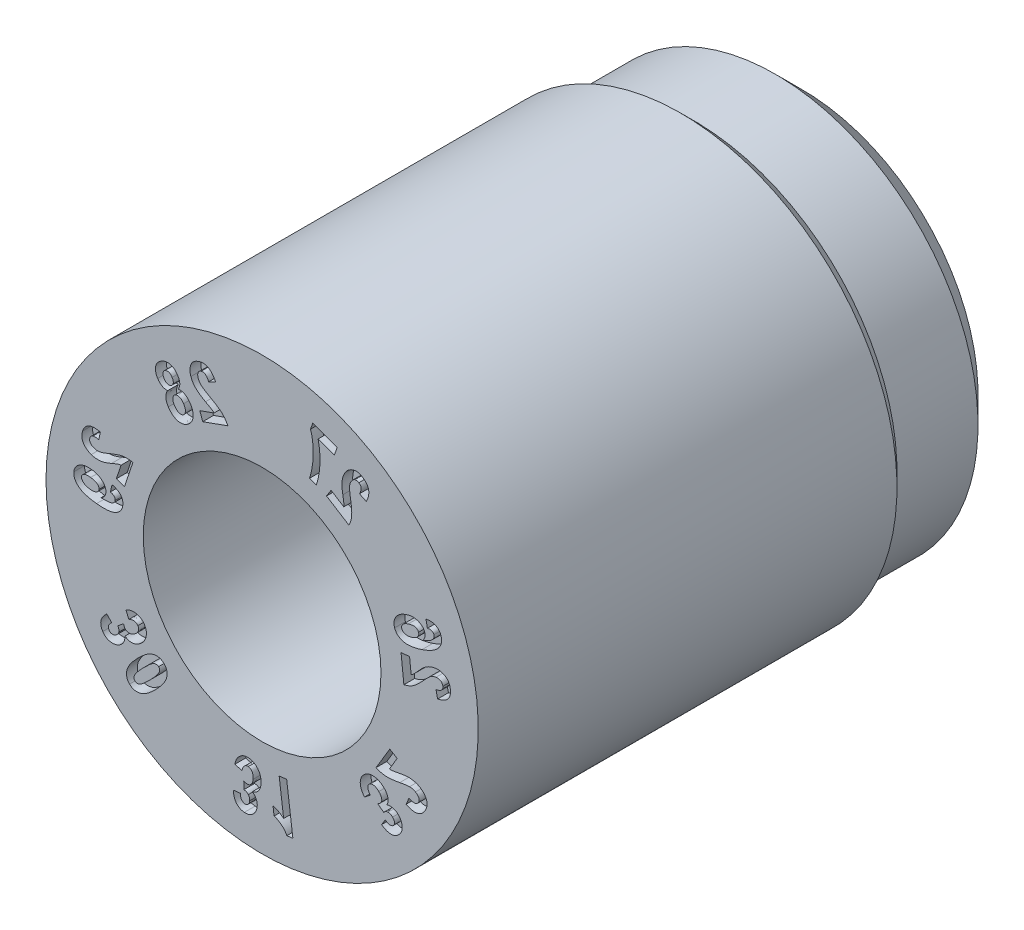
from build123d import *

# Parameters (mm, degrees)
CUT_EXTRUDE2_DEPTH = 0.2


with BuildPart() as part:
    # Sketch2 → Revolve1 (revolve)
    with BuildSketch(Plane(origin=(0, 0, 0), x_dir=(1, 0, 0), z_dir=(0, 1, 0)), mode=Mode.PRIVATE) as revolve1_sk:
        Polygon((3.249621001, 10), (1.15, 10), (1.15, 7.468), (2.2, 7.468), (2.2, 0), (4, 0), (4, 7.75), (3.75, 8), (3.75, 9.499621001), align=None)
    revolve(revolve1_sk.sketch.rotate(Axis((0, 0, -4.849143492), (0, 0, 1)), 180), axis=Axis((0, 0, -4.849143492), (0, 0, 1)))

    # Sketch8 → Cut-Extrude2 (cut)
    # profile 1 of 14: a face of its own
    with BuildSketch(Plane.XY):
        with BuildLine():
            Line((2.72887384, 0.530280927), (2.57118729, 0.513328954))
            Line((2.57118729, 0.513328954), (2.623660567, 0.02527858))
            add(Edge.make_bspline(
                [(2.623660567, 0.02527858), (2.638251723, 0.028520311), (2.667360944, 0.034987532), (2.709413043, 0.050084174), (2.750089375, 0.06853988), (2.782829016, 0.087511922), (2.808985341, 0.105583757), (2.83018659, 0.121491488), (2.852460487, 0.140181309), (2.876207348, 0.161249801), (2.900997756, 0.185162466), (2.927548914, 0.211146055), (2.955026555, 0.240078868), (2.973667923, 0.260298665), (2.983312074, 0.270759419)],
                knots=[0, 0, 0, 0, 1.210903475, 2.415741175, 3.614422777, 4.829304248, 5.477408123, 6.191639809, 6.977581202, 7.834306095, 8.765204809, 9.770030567, 10.846320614, 12, 12, 12, 12], degree=3))
            add(Edge.make_bspline(
                [(2.983312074, 0.270759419), (2.990868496, 0.278966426), (3.005290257, 0.294629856), (3.026166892, 0.316737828), (3.045039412, 0.336493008), (3.062378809, 0.353515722), (3.07737478, 0.368504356), (3.090672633, 0.380929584), (3.10207873, 0.39091499), (3.109355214, 0.396433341), (3.112595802, 0.398890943)],
                knots=[0, 0, 0, 0, 1.469359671, 2.804336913, 4.005076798, 5.067497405, 6.004650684, 6.797449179, 7.46444311, 8, 8, 8, 8], degree=3))
            add(Edge.make_bspline(
                [(3.112595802, 0.398890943), (3.120917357, 0.404670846), (3.137140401, 0.415938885), (3.16336227, 0.428661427), (3.190008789, 0.437728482), (3.208237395, 0.440552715), (3.217240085, 0.441947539)],
                knots=[0, 0, 0, 0, 1.061115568, 2.068666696, 3.046158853, 4, 4, 4, 4], degree=3))
            add(Edge.make_bspline(
                [(3.217240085, 0.441947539), (3.226380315, 0.442708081), (3.243617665, 0.444142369), (3.268130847, 0.441635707), (3.289603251, 0.435842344), (3.307755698, 0.42606176), (3.322572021, 0.413314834), (3.33374337, 0.397766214), (3.341534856, 0.379885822), (3.343547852, 0.366876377), (3.34458258, 0.360189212)],
                knots=[0, 0, 0, 0, 1.284830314, 2.42303217, 3.43989917, 4.386563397, 5.292301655, 6.158766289, 7.053562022, 8, 8, 8, 8], degree=3))
            add(Edge.make_bspline(
                [(3.34458258, 0.360189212), (3.34498587, 0.35285657), (3.345761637, 0.338751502), (3.341333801, 0.318259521), (3.331794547, 0.300184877), (3.317805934, 0.284318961), (3.299042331, 0.270964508), (3.275696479, 0.26029432), (3.248025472, 0.251205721), (3.227759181, 0.24751464), (3.216967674, 0.245549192)],
                knots=[0, 0, 0, 0, 0.913722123, 1.757635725, 2.579276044, 3.438933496, 4.37433614, 5.431505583, 6.632314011, 8, 8, 8, 8], degree=3))
            Line((3.216967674, 0.245549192), (3.24883615, 0.109245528))
            add(Edge.make_bspline(
                [(3.24883615, 0.109245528), (3.259602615, 0.111592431), (3.280512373, 0.116150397), (3.310489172, 0.124877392), (3.337984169, 0.135188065), (3.363183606, 0.146491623), (3.385886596, 0.159250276), (3.406218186, 0.173249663), (3.424103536, 0.188696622), (3.439586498, 0.205443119), (3.452732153, 0.223422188), (3.463883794, 0.242412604), (3.472847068, 0.262529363), (3.47943877, 0.283792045), (3.484341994, 0.306004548), (3.486735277, 0.329367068), (3.486941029, 0.353821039), (3.48557858, 0.370384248), (3.484879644, 0.378881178)],
                knots=[0, 0, 0, 0, 1.316678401, 2.557146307, 3.727226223, 4.823655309, 5.854584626, 6.835260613, 7.768888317, 8.673026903, 9.554907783, 10.425565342, 11.300463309, 12.180346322, 13.081818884, 14.014614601, 14.981496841, 16, 16, 16, 16], degree=3))
            add(Edge.make_bspline(
                [(3.484879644, 0.378881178), (3.483641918, 0.388092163), (3.481241, 0.405959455), (3.475135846, 0.43170585), (3.46661481, 0.455293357), (3.456183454, 0.477082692), (3.443316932, 0.496631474), (3.428482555, 0.514416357), (3.411246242, 0.529911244), (3.392200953, 0.543372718), (3.371958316, 0.554961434), (3.350988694, 0.564582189), (3.32954953, 0.572352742), (3.307687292, 0.578378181), (3.28530415, 0.582279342), (3.262466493, 0.584609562), (3.239134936, 0.584888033), (3.223494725, 0.583524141), (3.215612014, 0.582836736)],
                knots=[0, 0, 0, 0, 1.173652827, 2.276629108, 3.335023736, 4.336619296, 5.321091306, 6.283820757, 7.254537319, 8.239831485, 9.225125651, 10.197062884, 11.150738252, 12.103199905, 13.057936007, 14.017536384, 15.000832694, 16, 16, 16, 16], degree=3))
            add(Edge.make_bspline(
                [(3.215612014, 0.582836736), (3.206625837, 0.581693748), (3.188737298, 0.579418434), (3.162460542, 0.573523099), (3.13674131, 0.566051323), (3.111543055, 0.556889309), (3.086784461, 0.545622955), (3.062251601, 0.532456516), (3.037814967, 0.517245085), (3.01753481, 0.50297596), (3.000998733, 0.490113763), (2.987892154, 0.478778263), (2.973928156, 0.466191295), (2.959238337, 0.452163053), (2.943666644, 0.437001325), (2.927534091, 0.420192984), (2.910489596, 0.402157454), (2.899004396, 0.389509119), (2.89310942, 0.383017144)],
                knots=[0, 0, 0, 0, 1.116805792, 2.223195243, 3.31725657, 4.418851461, 5.527133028, 6.669491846, 7.850789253, 9.075422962, 9.72636706, 10.433968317, 11.212223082, 12.045064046, 12.93920453, 13.892729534, 14.918407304, 16, 16, 16, 16], degree=3))
            add(Edge.make_bspline(
                [(2.89310942, 0.383017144), (2.887649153, 0.377010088), (2.87724621, 0.365565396), (2.862346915, 0.349315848), (2.848698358, 0.334962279), (2.836966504, 0.321857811), (2.826122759, 0.310994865), (2.817159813, 0.301449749), (2.80935657, 0.293897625), (2.797742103, 0.282711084), (2.781544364, 0.268629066), (2.765999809, 0.258562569), (2.758532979, 0.253727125)],
                knots=[0, 0, 0, 0, 1.30077431, 2.478245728, 3.532467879, 4.474445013, 5.295791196, 5.991390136, 6.572169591, 7.035389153, 8.575948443, 10, 10, 10, 10], degree=3))
            Line((2.758532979, 0.253727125), (2.72887384, 0.530280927))
        make_face()
    # profile 2 of 14: a face of its own
    with BuildSketch(Plane.XY):
        with BuildLine():
            Line((3.032753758, 1.28241746), (3.05914338, 1.148167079))
            add(Edge.make_bspline(
                [(3.05914338, 1.148167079), (3.0668598, 1.149847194), (3.081419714, 1.153017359), (3.102492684, 1.154568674), (3.121310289, 1.153596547), (3.137754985, 1.149392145), (3.152097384, 1.142714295), (3.163877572, 1.132805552), (3.173239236, 1.120014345), (3.177256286, 1.110081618), (3.179348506, 1.104908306)],
                knots=[0, 0, 0, 0, 1.330334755, 2.510174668, 3.553125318, 4.493430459, 5.356099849, 6.19851809, 7.061724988, 8, 8, 8, 8], degree=3))
            add(Edge.make_bspline(
                [(3.179348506, 1.104908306), (3.180399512, 1.101332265), (3.182479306, 1.094255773), (3.183814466, 1.083273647), (3.183225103, 1.07226135), (3.181122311, 1.061236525), (3.177508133, 1.050108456), (3.171938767, 1.039088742), (3.164906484, 1.027989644), (3.156248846, 1.016618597), (3.145119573, 1.004986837), (3.130623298, 0.993445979), (3.113111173, 0.981388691), (3.092405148, 0.968933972), (3.06839963, 0.956304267), (3.041217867, 0.943133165), (3.010851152, 0.929558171), (2.989410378, 0.92076327), (2.97822335, 0.916174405)],
                knots=[0, 0, 0, 0, 0.592904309, 1.173275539, 1.751425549, 2.342155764, 2.956377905, 3.608061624, 4.302617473, 5.046745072, 5.880567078, 6.858832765, 7.991524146, 9.265112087, 10.704042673, 12.30969237, 14.074529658, 16, 16, 16, 16], degree=3))
            add(Edge.make_bspline(
                [(2.97822335, 0.916174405), (2.982486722, 0.922256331), (2.990758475, 0.934056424), (3.000880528, 0.952520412), (3.008108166, 0.97108584), (3.01341024, 0.989461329), (3.015885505, 1.007950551), (3.01595691, 1.026433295), (3.013491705, 1.044998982), (3.009815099, 1.057013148), (3.007947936, 1.063114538)],
                knots=[0, 0, 0, 0, 1.139468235, 2.210785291, 3.221715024, 4.191838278, 5.139167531, 6.074298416, 7.022033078, 8, 8, 8, 8], degree=3))
            add(Edge.make_bspline(
                [(3.007947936, 1.063114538), (3.005433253, 1.069712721), (3.000444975, 1.08280128), (2.990204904, 1.101065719), (2.977726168, 1.117794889), (2.963190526, 1.133076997), (2.946457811, 1.1469669), (2.927545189, 1.159267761), (2.906488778, 1.170082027), (2.883684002, 1.179441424), (2.859311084, 1.186896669), (2.833714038, 1.19181474), (2.807252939, 1.194431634), (2.779855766, 1.194813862), (2.751637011, 1.192203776), (2.722478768, 1.187640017), (2.69242662, 1.180511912), (2.672392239, 1.174067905), (2.662107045, 1.170759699)],
                knots=[0, 0, 0, 0, 0.842053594, 1.670348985, 2.489711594, 3.327769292, 4.182061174, 5.079771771, 6.015342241, 7.003867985, 8.018865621, 9.052517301, 10.10990296, 11.189593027, 12.317839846, 13.488410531, 14.71060735, 16, 16, 16, 16], degree=3))
            add(Edge.make_bspline(
                [(2.662107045, 1.170759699), (2.651308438, 1.166899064), (2.630316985, 1.159394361), (2.600598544, 1.145795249), (2.573270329, 1.131056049), (2.548481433, 1.114708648), (2.526131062, 1.097081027), (2.506160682, 1.078163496), (2.488796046, 1.057646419), (2.474093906, 1.035840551), (2.461953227, 1.013313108), (2.452314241, 0.990558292), (2.445388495, 0.96766538), (2.441428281, 0.944583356), (2.439915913, 0.921398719), (2.441248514, 0.89804839), (2.445043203, 0.874451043), (2.449847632, 0.859088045), (2.45228608, 0.851290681)],
                knots=[0, 0, 0, 0, 1.28535219, 2.498600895, 3.66049551, 4.763734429, 5.82358132, 6.84854775, 7.842826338, 8.831129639, 9.792013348, 10.707960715, 11.597792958, 12.467321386, 13.328372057, 14.19714035, 15.084973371, 16, 16, 16, 16], degree=3))
            add(Edge.make_bspline(
                [(2.45228608, 0.851290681), (2.455462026, 0.84293963), (2.461731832, 0.82645337), (2.474878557, 0.803635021), (2.490563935, 0.782929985), (2.508986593, 0.764344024), (2.530336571, 0.74827761), (2.554098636, 0.733955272), (2.580795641, 0.722305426), (2.610074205, 0.712430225), (2.642530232, 0.705558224), (2.678238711, 0.702200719), (2.717263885, 0.702719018), (2.759528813, 0.706440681), (2.805085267, 0.713749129), (2.853893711, 0.72450131), (2.905994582, 0.739009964), (2.941559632, 0.750638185), (2.960005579, 0.756669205)],
                knots=[0, 0, 0, 0, 0.743322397, 1.46743283, 2.184580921, 2.902395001, 3.639568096, 4.405059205, 5.208335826, 6.060957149, 6.975334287, 7.96520218, 9.042425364, 10.222078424, 11.496819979, 12.883183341, 14.383451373, 16, 16, 16, 16], degree=3))
            add(Edge.make_bspline(
                [(2.960005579, 0.756669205), (2.978632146, 0.763169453), (3.014566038, 0.775709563), (3.065300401, 0.796998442), (3.111488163, 0.818493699), (3.152645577, 0.841330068), (3.189186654, 0.86467894), (3.220969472, 0.888913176), (3.247736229, 0.914207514), (3.269716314, 0.940371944), (3.287600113, 0.966871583), (3.301510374, 0.99377232), (3.312363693, 1.020661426), (3.319086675, 1.047916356), (3.322227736, 1.075283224), (3.321974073, 1.102836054), (3.317791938, 1.13060765), (3.312334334, 1.148673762), (3.309567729, 1.157831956)],
                knots=[0, 0, 0, 0, 1.590623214, 3.068589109, 4.435088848, 5.697077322, 6.861449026, 7.929522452, 8.91549332, 9.824912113, 10.680046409, 11.488073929, 12.263229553, 13.013100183, 13.744384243, 14.479413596, 15.229174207, 16, 16, 16, 16], degree=3))
            add(Edge.make_bspline(
                [(3.309567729, 1.157831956), (3.307300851, 1.164024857), (3.302816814, 1.176274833), (3.294225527, 1.193564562), (3.284270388, 1.20957032), (3.272738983, 1.224141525), (3.259954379, 1.237502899), (3.245822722, 1.249639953), (3.23021746, 1.260240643), (3.213378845, 1.269684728), (3.195198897, 1.277637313), (3.175657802, 1.283580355), (3.154945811, 1.287744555), (3.132965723, 1.290373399), (3.109636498, 1.290932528), (3.085034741, 1.290000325), (3.059193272, 1.287307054), (3.041733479, 1.284078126), (3.032753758, 1.28241746)],
                knots=[0, 0, 0, 0, 0.942722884, 1.864769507, 2.755859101, 3.634209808, 4.517610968, 5.397479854, 6.293382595, 7.211480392, 8.155735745, 9.125710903, 10.126944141, 11.174289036, 12.287857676, 13.461023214, 14.694182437, 16, 16, 16, 16], degree=3))
        make_face()
        with BuildLine():
            add(Edge.make_bspline(
                [(2.782200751, 0.862246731), (2.775688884, 0.860096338), (2.763080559, 0.855932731), (2.744334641, 0.851150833), (2.726475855, 0.847606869), (2.709416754, 0.84541781), (2.693204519, 0.844454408), (2.677895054, 0.845087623), (2.66339257, 0.846672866), (2.649913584, 0.849961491), (2.637429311, 0.853906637), (2.626189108, 0.858906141), (2.616188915, 0.864588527), (2.60712882, 0.87065839), (2.59965293, 0.877840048), (2.593167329, 0.885547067), (2.58789319, 0.894050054), (2.585509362, 0.900249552), (2.58432295, 0.903334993)],
                knots=[0, 0, 0, 0, 1.477315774, 2.860389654, 4.165661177, 5.398195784, 6.564007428, 7.660189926, 8.696724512, 9.701606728, 10.644280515, 11.51494483, 12.346158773, 13.121548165, 13.857295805, 14.571221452, 15.28890834, 16, 16, 16, 16], degree=3))
            add(Edge.make_bspline(
                [(2.58432295, 0.903334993), (2.582692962, 0.909464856), (2.579484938, 0.921529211), (2.58113226, 0.940620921), (2.587111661, 0.959426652), (2.596287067, 0.974384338), (2.605978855, 0.986087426), (2.615301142, 0.99475541), (2.626293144, 1.003162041), (2.638889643, 1.011256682), (2.653206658, 1.018902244), (2.668948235, 1.026611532), (2.686593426, 1.033613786), (2.698940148, 1.038065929), (2.705351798, 1.040377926)],
                knots=[0, 0, 0, 0, 1.112703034, 2.189941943, 3.328406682, 4.57426261, 5.260445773, 6.008428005, 6.816492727, 7.702117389, 8.649537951, 9.681760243, 10.796138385, 12, 12, 12, 12], degree=3))
            add(Edge.make_bspline(
                [(2.705351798, 1.040377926), (2.712047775, 1.04257523), (2.725001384, 1.046825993), (2.74404829, 1.051957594), (2.761992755, 1.055765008), (2.778796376, 1.05817017), (2.794473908, 1.059718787), (2.809029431, 1.059390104), (2.822551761, 1.058216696), (2.838536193, 1.054530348), (2.856300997, 1.047905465), (2.874019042, 1.036045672), (2.887768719, 1.020871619), (2.892935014, 1.008626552), (2.895529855, 1.002476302)],
                knots=[0, 0, 0, 0, 1.175356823, 2.273770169, 3.288782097, 4.232920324, 5.10476178, 5.912420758, 6.658286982, 7.364144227, 8.643709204, 9.796412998, 10.893218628, 12, 12, 12, 12], degree=3))
            add(Edge.make_bspline(
                [(2.895529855, 1.002476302), (2.897198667, 0.996171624), (2.900514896, 0.9836431), (2.899329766, 0.963697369), (2.892863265, 0.94399957), (2.883611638, 0.928166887), (2.873793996, 0.915879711), (2.864887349, 0.906729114), (2.85450603, 0.898102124), (2.842758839, 0.889983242), (2.829544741, 0.882451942), (2.815062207, 0.875135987), (2.799133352, 0.868377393), (2.787948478, 0.864327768), (2.782200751, 0.862246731)],
                knots=[0, 0, 0, 0, 1.163881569, 2.312840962, 3.522987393, 4.854472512, 5.577293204, 6.340826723, 7.140534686, 7.994669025, 8.898739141, 9.866531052, 10.903644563, 12, 12, 12, 12], degree=3))
        make_face(mode=Mode.SUBTRACT)
    # profile 3 of 14: a face of its own
    with BuildSketch(Plane.XY):
        with BuildLine():
            Line((1.276591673, 2.468546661), (1.192384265, 2.3346842))
            Line((1.192384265, 2.3346842), (1.607103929, 2.073959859))
            add(Edge.make_bspline(
                [(1.607103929, 2.073959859), (1.613544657, 2.087381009), (1.62641751, 2.114205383), (1.640797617, 2.156374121), (1.651263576, 2.19970255), (1.656801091, 2.23699331), (1.658800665, 2.268688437), (1.659160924, 2.295146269), (1.658633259, 2.32420232), (1.6567436, 2.35582735), (1.653653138, 2.390051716), (1.649238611, 2.426885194), (1.643833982, 2.466330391), (1.639590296, 2.493456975), (1.637400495, 2.50745467)],
                knots=[0, 0, 0, 0, 1.208822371, 2.41603029, 3.61173594, 4.82739827, 5.473599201, 6.191163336, 6.976981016, 7.83455647, 8.764940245, 9.768954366, 10.848749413, 12, 12, 12, 12], degree=3))
            add(Edge.make_bspline(
                [(1.637400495, 2.50745467), (1.635678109, 2.518461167), (1.632395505, 2.539437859), (1.62802686, 2.569453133), (1.624041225, 2.596446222), (1.621316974, 2.620533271), (1.619170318, 2.641622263), (1.617581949, 2.659700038), (1.616756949, 2.674832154), (1.616994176, 2.683913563), (1.617099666, 2.68795186)],
                knots=[0, 0, 0, 0, 1.470404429, 2.802365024, 4.003523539, 5.071488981, 6.001522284, 6.801330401, 7.466978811, 8, 8, 8, 8], degree=3))
            add(Edge.make_bspline(
                [(1.617099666, 2.68795186), (1.617731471, 2.698043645), (1.618964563, 2.717739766), (1.625226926, 2.746130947), (1.634390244, 2.772711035), (1.643576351, 2.788664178), (1.648122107, 2.79655861)],
                knots=[0, 0, 0, 0, 1.060684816, 2.070137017, 3.045005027, 4, 4, 4, 4], degree=3))
            add(Edge.make_bspline(
                [(1.648122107, 2.79655861), (1.65319842, 2.804171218), (1.662774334, 2.818531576), (1.679785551, 2.836252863), (1.697385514, 2.849725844), (1.716243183, 2.857736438), (1.735315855, 2.861255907), (1.754365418, 2.860600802), (1.773229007, 2.855589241), (1.784685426, 2.849146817), (1.79058099, 2.845831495)],
                knots=[0, 0, 0, 0, 1.286212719, 2.426300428, 3.443909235, 4.385890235, 5.28260689, 6.154823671, 7.050457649, 8, 8, 8, 8], degree=3))
            add(Edge.make_bspline(
                [(1.79058099, 2.845831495), (1.796590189, 2.841598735), (1.80813509, 2.833466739), (1.821327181, 2.817240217), (1.829837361, 2.798733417), (1.833565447, 2.777902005), (1.832267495, 2.754958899), (1.826442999, 2.730003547), (1.816132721, 2.702891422), (1.806627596, 2.684738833), (1.801569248, 2.675078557)],
                knots=[0, 0, 0, 0, 0.916356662, 1.760508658, 2.58176228, 3.440675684, 4.380995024, 5.437493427, 6.636309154, 8, 8, 8, 8], degree=3))
            Line((1.801569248, 2.675078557), (1.928108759, 2.615611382))
            add(Edge.make_bspline(
                [(1.928108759, 2.615611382), (1.932929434, 2.625502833), (1.942287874, 2.644705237), (1.953773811, 2.673592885), (1.963088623, 2.701347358), (1.969657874, 2.728113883), (1.973545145, 2.753824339), (1.975434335, 2.778431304), (1.974241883, 2.80201835), (1.970705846, 2.824584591), (1.964716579, 2.845992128), (1.95678847, 2.866502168), (1.946264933, 2.885812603), (1.934047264, 2.904424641), (1.91924611, 2.921759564), (1.902479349, 2.938161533), (1.88357785, 2.953636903), (1.869732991, 2.962763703), (1.86265978, 2.967426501)],
                knots=[0, 0, 0, 0, 1.316512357, 2.555762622, 3.717505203, 4.818052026, 5.849248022, 6.826902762, 7.766324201, 8.668970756, 9.555046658, 10.422053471, 11.294580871, 12.182061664, 13.082001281, 14.016408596, 14.986601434, 16, 16, 16, 16], degree=3))
            add(Edge.make_bspline(
                [(1.86265978, 2.967426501), (1.854712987, 2.972209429), (1.83929078, 2.981491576), (1.815187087, 2.992226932), (1.791516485, 3.000378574), (1.767999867, 3.005477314), (1.744753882, 3.007632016), (1.721696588, 3.006821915), (1.698904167, 3.003075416), (1.676627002, 2.996441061), (1.655205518, 2.987535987), (1.634572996, 2.977325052), (1.615259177, 2.965267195), (1.596893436, 2.951992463), (1.580175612, 2.936594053), (1.564163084, 2.920217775), (1.549503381, 2.902049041), (1.540921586, 2.888944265), (1.536575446, 2.88230752)],
                knots=[0, 0, 0, 0, 1.173365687, 2.277131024, 3.333562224, 4.338328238, 5.316104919, 6.281955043, 7.251497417, 8.232655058, 9.217801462, 10.185934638, 11.143842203, 12.097616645, 13.050385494, 14.017437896, 14.995957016, 16, 16, 16, 16], degree=3))
            add(Edge.make_bspline(
                [(1.536575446, 2.88230752), (1.531941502, 2.874569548), (1.52272158, 2.859173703), (1.510837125, 2.83506583), (1.500650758, 2.810327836), (1.492452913, 2.784794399), (1.486046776, 2.75844261), (1.48106032, 2.731064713), (1.477939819, 2.702502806), (1.47652586, 2.677754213), (1.476633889, 2.656845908), (1.477067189, 2.639594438), (1.478287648, 2.620908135), (1.480274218, 2.60080827), (1.482553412, 2.579238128), (1.485729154, 2.556245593), (1.489257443, 2.531722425), (1.492125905, 2.514919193), (1.493603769, 2.506261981)],
                knots=[0, 0, 0, 0, 1.114583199, 2.217628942, 3.318941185, 4.419045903, 5.529098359, 6.669323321, 7.85651922, 9.078812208, 9.731191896, 10.440705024, 11.21182148, 12.045370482, 12.937425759, 13.892879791, 14.914388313, 16, 16, 16, 16], degree=3))
            add(Edge.make_bspline(
                [(1.493603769, 2.506261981), (1.494931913, 2.49827585), (1.497456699, 2.483094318), (1.500843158, 2.46135842), (1.503906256, 2.441888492), (1.506421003, 2.424532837), (1.508470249, 2.409382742), (1.51044169, 2.396412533), (1.511632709, 2.385582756), (1.513070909, 2.369495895), (1.513897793, 2.348098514), (1.512380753, 2.329686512), (1.511654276, 2.320869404)],
                knots=[0, 0, 0, 0, 1.299886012, 2.471066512, 3.532081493, 4.464485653, 5.286776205, 5.986809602, 6.570702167, 7.03567512, 8.58044916, 10, 10, 10, 10], degree=3))
            Line((1.511654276, 2.320869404), (1.276591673, 2.468546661))
        make_face()
    # profile 4 of 14: a face of its own
    with BuildSketch(Plane.XY):
        with BuildLine():
            Line((1.337442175, 3.064145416), (1.390417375, 3.214511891))
            Line((1.390417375, 3.214511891), (0.936502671, 3.374550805))
            Line((0.936502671, 3.374550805), (0.895190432, 3.257016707))
            add(Edge.make_bspline(
                [(0.895190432, 3.257016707), (0.897809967, 3.249474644), (0.903213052, 3.233918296), (0.910386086, 3.209441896), (0.917035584, 3.183209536), (0.922920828, 3.155124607), (0.928219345, 3.125276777), (0.933144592, 3.093645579), (0.937464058, 3.060232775), (0.94227678, 3.013156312), (0.946168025, 2.95258819), (0.946996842, 2.878707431), (0.94351604, 2.803732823), (0.937563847, 2.740878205), (0.930617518, 2.690897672), (0.925162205, 2.654367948), (0.918627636, 2.619042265), (0.911767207, 2.5847888), (0.903782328, 2.551797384), (0.895294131, 2.519944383), (0.886411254, 2.489160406), (0.879509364, 2.469230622), (0.876105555, 2.459401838)],
                knots=[0, 0, 0, 0, 0.591113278, 1.21923731, 1.887874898, 2.59449686, 3.343437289, 4.132341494, 4.964681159, 5.837787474, 7.636012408, 9.456677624, 11.305753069, 13.191147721, 14.129159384, 15.04201772, 15.925710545, 16.788975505, 17.628387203, 18.438540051, 19.229933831, 20, 20, 20, 20], degree=3))
            Line((0.876105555, 2.459401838), (1.003917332, 2.414430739))
            add(Edge.make_bspline(
                [(1.003917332, 2.414430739), (1.008648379, 2.429619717), (1.018116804, 2.460018), (1.030535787, 2.506166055), (1.04124353, 2.552854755), (1.050373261, 2.600082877), (1.057804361, 2.647890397), (1.063929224, 2.696174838), (1.06820561, 2.745007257), (1.070890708, 2.794211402), (1.072082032, 2.843374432), (1.071601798, 2.892070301), (1.069871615, 2.940100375), (1.065984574, 2.987458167), (1.060806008, 3.034191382), (1.054095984, 3.080293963), (1.045934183, 3.125798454), (1.038968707, 3.155709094), (1.035498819, 3.170609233)],
                knots=[0, 0, 0, 0, 0.996771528, 1.994876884, 2.993602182, 3.997655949, 5.008277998, 6.024691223, 7.046834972, 8.079077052, 9.111966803, 10.127679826, 11.130138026, 12.122732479, 13.104313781, 14.075929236, 15.04151434, 16, 16, 16, 16], degree=3))
            Line((1.035498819, 3.170609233), (1.337442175, 3.064145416))
        make_face()
    # profile 5 of 14: a face of its own
    with BuildSketch(Plane.XY):
        with BuildLine():
            Line((-1.153116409, 2.530311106), (-1.099541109, 2.380093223))
            Line((-1.099541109, 2.380093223), (-0.63463606, 2.545921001))
            add(Edge.make_bspline(
                [(-0.63463606, 2.545921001), (-0.641225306, 2.55943034), (-0.65435385, 2.586346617), (-0.678850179, 2.623978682), (-0.706512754, 2.659353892), (-0.732569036, 2.687107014), (-0.756279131, 2.708594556), (-0.777064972, 2.725260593), (-0.800477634, 2.742761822), (-0.826633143, 2.761085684), (-0.855680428, 2.780042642), (-0.887556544, 2.79960568), (-0.92212944, 2.820006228), (-0.946304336, 2.833428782), (-0.958805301, 2.840369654)],
                knots=[0, 0, 0, 0, 1.210812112, 2.412446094, 3.611470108, 4.827949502, 5.475904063, 6.189792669, 6.974926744, 7.832254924, 8.763959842, 9.770840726, 10.847290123, 12, 12, 12, 12], degree=3))
            add(Edge.make_bspline(
                [(-0.958805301, 2.840369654), (-0.968566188, 2.84584207), (-0.987220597, 2.856300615), (-1.013805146, 2.871388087), (-1.037510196, 2.885307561), (-1.058359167, 2.898005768), (-1.076506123, 2.909247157), (-1.091725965, 2.919379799), (-1.104216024, 2.928109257), (-1.11125292, 2.933906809), (-1.114388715, 2.936490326)],
                knots=[0, 0, 0, 0, 1.466976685, 2.803596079, 4.007152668, 5.070478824, 6.003858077, 6.805146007, 7.46754678, 8, 8, 8, 8], degree=3))
            add(Edge.make_bspline(
                [(-1.114388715, 2.936490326), (-1.122002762, 2.943299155), (-1.136851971, 2.956577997), (-1.155425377, 2.979283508), (-1.170651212, 3.003209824), (-1.177572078, 3.02044326), (-1.181002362, 3.028984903)],
                knots=[0, 0, 0, 0, 1.061716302, 2.070600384, 3.043705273, 4, 4, 4, 4], degree=3))
            add(Edge.make_bspline(
                [(-1.181002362, 3.028984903), (-1.183842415, 3.037775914), (-1.189177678, 3.054290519), (-1.192666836, 3.078837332), (-1.191970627, 3.10117609), (-1.186719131, 3.121203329), (-1.17765285, 3.138565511), (-1.165336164, 3.15322221), (-1.149545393, 3.164879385), (-1.137353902, 3.169934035), (-1.131024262, 3.172558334)],
                knots=[0, 0, 0, 0, 1.28889712, 2.421294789, 3.446017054, 4.391561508, 5.288374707, 6.161078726, 7.045259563, 8, 8, 8, 8], degree=3))
            add(Edge.make_bspline(
                [(-1.131024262, 3.172558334), (-1.123935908, 3.174705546), (-1.110299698, 3.178836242), (-1.089193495, 3.179225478), (-1.069225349, 3.174268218), (-1.05062608, 3.163973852), (-1.033034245, 3.148956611), (-1.016926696, 3.128703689), (-1.002027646, 3.103503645), (-0.993589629, 3.084641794), (-0.989103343, 3.074613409)],
                knots=[0, 0, 0, 0, 0.915818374, 1.761804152, 2.583658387, 3.441146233, 4.376057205, 5.436996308, 6.637313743, 8, 8, 8, 8], degree=3))
            Line((-0.989103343, 3.074613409), (-0.863066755, 3.137827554))
            add(Edge.make_bspline(
                [(-0.863066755, 3.137827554), (-0.867877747, 3.147849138), (-0.877204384, 3.167277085), (-0.892856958, 3.194464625), (-0.909301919, 3.218978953), (-0.926386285, 3.240884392), (-0.944149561, 3.260165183), (-0.962587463, 3.276842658), (-0.981817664, 3.290850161), (-1.001990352, 3.301874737), (-1.022646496, 3.310612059), (-1.043939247, 3.316852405), (-1.065727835, 3.320874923), (-1.088051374, 3.322611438), (-1.110939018, 3.322001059), (-1.134318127, 3.318623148), (-1.158367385, 3.313472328), (-1.174243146, 3.308186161), (-1.182373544, 3.305478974)],
                knots=[0, 0, 0, 0, 1.319771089, 2.558521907, 3.721606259, 4.82275391, 5.854211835, 6.830927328, 7.770817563, 8.672209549, 9.55489539, 10.429349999, 11.30169805, 12.181513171, 13.083783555, 14.01438395, 14.983113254, 16, 16, 16, 16], degree=3))
            add(Edge.make_bspline(
                [(-1.182373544, 3.305478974), (-1.19110363, 3.302166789), (-1.208064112, 3.295732), (-1.231583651, 3.283437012), (-1.252844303, 3.269801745), (-1.271564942, 3.254362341), (-1.287708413, 3.2371381), (-1.301476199, 3.218483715), (-1.312791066, 3.198154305), (-1.321367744, 3.176408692), (-1.327765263, 3.153905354), (-1.332494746, 3.13116733), (-1.334962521, 3.108314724), (-1.33582973, 3.085466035), (-1.334531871, 3.062641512), (-1.331042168, 3.039799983), (-1.325955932, 3.01684882), (-1.320929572, 3.001825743), (-1.31839906, 2.994262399)],
                knots=[0, 0, 0, 0, 1.172052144, 2.277018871, 3.32677887, 4.340170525, 5.316659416, 6.285120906, 7.245666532, 8.230669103, 9.214509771, 10.181848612, 11.144446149, 12.098449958, 13.051434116, 14.011175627, 14.998729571, 16, 16, 16, 16], degree=3))
            add(Edge.make_bspline(
                [(-1.31839906, 2.994262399), (-1.315172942, 2.985750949), (-1.308758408, 2.968827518), (-1.297236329, 2.94430017), (-1.283697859, 2.92101438), (-1.268708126, 2.898599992), (-1.252019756, 2.876932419), (-1.233263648, 2.85611405), (-1.21271418, 2.83573777), (-1.1939129, 2.819405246), (-1.177355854, 2.80632404), (-1.163352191, 2.795971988), (-1.14773954, 2.785273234), (-1.130762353, 2.774071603), (-1.112145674, 2.762578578), (-1.092128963, 2.750475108), (-1.070377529, 2.738257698), (-1.055402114, 2.729925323), (-1.047704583, 2.72564239)],
                knots=[0, 0, 0, 0, 1.116679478, 2.220308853, 3.320570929, 4.4187232, 5.527162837, 6.673310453, 7.854533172, 9.07624537, 9.726844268, 10.443494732, 11.21262712, 12.049020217, 12.939050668, 13.897081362, 14.919076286, 16, 16, 16, 16], degree=3))
            add(Edge.make_bspline(
                [(-1.047704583, 2.72564239), (-1.04058741, 2.721649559), (-1.027016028, 2.714035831), (-1.007481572, 2.703458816), (-0.990196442, 2.693552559), (-0.974839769, 2.684822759), (-0.961501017, 2.677063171), (-0.950179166, 2.670280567), (-0.940802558, 2.664590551), (-0.927130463, 2.655844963), (-0.909868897, 2.642944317), (-0.896232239, 2.630317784), (-0.889701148, 2.624270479)],
                knots=[0, 0, 0, 0, 1.300063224, 2.479025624, 3.538716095, 4.473772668, 5.293181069, 5.997018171, 6.576348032, 7.040371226, 8.58252631, 10, 10, 10, 10], degree=3))
            Line((-0.889701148, 2.624270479), (-1.153116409, 2.530311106))
        make_face()
    # profile 6 of 14: a face of its own
    with BuildSketch(Plane.XY):
        with BuildLine():
            add(Edge.make_bspline(
                [(-1.550789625, 2.677562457), (-1.546319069, 2.685906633), (-1.537607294, 2.702166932), (-1.528806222, 2.728109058), (-1.523853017, 2.754313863), (-1.52316716, 2.780964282), (-1.526625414, 2.807797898), (-1.533999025, 2.834885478), (-1.545283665, 2.862287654), (-1.555677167, 2.879703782), (-1.561041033, 2.888691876)],
                knots=[0, 0, 0, 0, 1.015256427, 1.978430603, 2.92882553, 3.869538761, 4.829060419, 5.82416835, 6.877099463, 8, 8, 8, 8], degree=3))
            add(Edge.make_bspline(
                [(-1.561041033, 2.888691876), (-1.565791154, 2.895803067), (-1.575043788, 2.909654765), (-1.590240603, 2.928851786), (-1.606492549, 2.945816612), (-1.623508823, 2.960789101), (-1.641451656, 2.973623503), (-1.660283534, 2.984227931), (-1.680041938, 2.992558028), (-1.700423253, 2.998974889), (-1.721336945, 3.002836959), (-1.742424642, 3.00471391), (-1.763630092, 3.004106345), (-1.784900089, 3.001205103), (-1.806199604, 2.995777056), (-1.827465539, 2.987983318), (-1.848928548, 2.978204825), (-1.862636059, 2.969917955), (-1.869643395, 2.965681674)],
                knots=[0, 0, 0, 0, 1.142175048, 2.224811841, 3.26587686, 4.276681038, 5.248501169, 6.207693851, 7.157535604, 8.108364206, 9.056399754, 9.992972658, 10.931718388, 11.884178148, 12.855199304, 13.861771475, 14.906928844, 16, 16, 16, 16], degree=3))
            add(Edge.make_bspline(
                [(-1.869643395, 2.965681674), (-1.876867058, 2.960945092), (-1.89092032, 2.951730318), (-1.909824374, 2.935938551), (-1.926440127, 2.919364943), (-1.940665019, 2.901882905), (-1.952327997, 2.883456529), (-1.961322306, 2.864027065), (-1.968008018, 2.843764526), (-1.972125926, 2.822695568), (-1.974134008, 2.801355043), (-1.974002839, 2.779989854), (-1.972050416, 2.758786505), (-1.968304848, 2.737686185), (-1.962348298, 2.716831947), (-1.954407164, 2.696229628), (-1.94481659, 2.675665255), (-1.936849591, 2.662557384), (-1.932796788, 2.655889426)],
                knots=[0, 0, 0, 0, 1.161762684, 2.26014869, 3.308224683, 4.316361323, 5.287179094, 6.235177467, 7.190900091, 8.151828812, 9.11817337, 10.071247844, 11.023081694, 11.980965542, 12.951242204, 13.936923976, 14.95051566, 16, 16, 16, 16], degree=3))
            add(Edge.make_bspline(
                [(-1.932796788, 2.655889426), (-1.926944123, 2.647176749), (-1.915561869, 2.630232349), (-1.895435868, 2.608034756), (-1.873781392, 2.589212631), (-1.85026542, 2.574590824), (-1.825879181, 2.563158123), (-1.800626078, 2.555901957), (-1.774772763, 2.551831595), (-1.757428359, 2.552457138), (-1.748665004, 2.552773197)],
                knots=[0, 0, 0, 0, 1.132940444, 2.203340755, 3.227511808, 4.223251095, 5.186147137, 6.128383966, 7.054355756, 8, 8, 8, 8], degree=3))
            add(Edge.make_bspline(
                [(-1.748665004, 2.552773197), (-1.754231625, 2.542959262), (-1.765086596, 2.523821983), (-1.776216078, 2.493185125), (-1.782195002, 2.462059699), (-1.782985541, 2.430357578), (-1.778896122, 2.398143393), (-1.769693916, 2.36543467), (-1.755740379, 2.332074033), (-1.743007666, 2.310744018), (-1.736400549, 2.299675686)],
                knots=[0, 0, 0, 0, 1.006145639, 1.961994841, 2.895545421, 3.824503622, 4.781833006, 5.784122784, 6.850161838, 8, 8, 8, 8], degree=3))
            add(Edge.make_bspline(
                [(-1.736400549, 2.299675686), (-1.728958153, 2.2885888), (-1.714404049, 2.266907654), (-1.689290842, 2.23792599), (-1.662188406, 2.212978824), (-1.633273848, 2.192390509), (-1.603146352, 2.176191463), (-1.572389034, 2.164394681), (-1.540992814, 2.157527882), (-1.50931762, 2.155520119), (-1.477832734, 2.157960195), (-1.446992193, 2.164917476), (-1.417031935, 2.176474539), (-1.398346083, 2.187256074), (-1.38885492, 2.192732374)],
                knots=[0, 0, 0, 0, 1.17773046, 2.303130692, 3.375463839, 4.421974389, 5.427344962, 6.387072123, 7.320190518, 8.252597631, 9.178563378, 10.098027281, 11.033925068, 12, 12, 12, 12], degree=3))
            add(Edge.make_bspline(
                [(-1.38885492, 2.192732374), (-1.381684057, 2.197494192), (-1.367572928, 2.206864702), (-1.348435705, 2.223130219), (-1.331465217, 2.240644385), (-1.316597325, 2.259428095), (-1.304015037, 2.279592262), (-1.293491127, 2.301085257), (-1.285576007, 2.324024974), (-1.279424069, 2.347904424), (-1.276145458, 2.372639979), (-1.275164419, 2.397713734), (-1.277025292, 2.423049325), (-1.281913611, 2.44845909), (-1.288829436, 2.47424205), (-1.299005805, 2.50002059), (-1.311589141, 2.526096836), (-1.321708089, 2.543035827), (-1.326882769, 2.551698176)],
                knots=[0, 0, 0, 0, 1.008320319, 1.984215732, 2.937081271, 3.863233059, 4.786692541, 5.7182056, 6.661934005, 7.62653811, 8.604039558, 9.580674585, 10.56361186, 11.574275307, 12.609882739, 13.688106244, 14.817731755, 16, 16, 16, 16], degree=3))
            add(Edge.make_bspline(
                [(-1.326882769, 2.551698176), (-1.334079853, 2.562432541), (-1.348014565, 2.583215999), (-1.372435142, 2.610508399), (-1.398430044, 2.633559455), (-1.426373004, 2.651980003), (-1.45586595, 2.665669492), (-1.486638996, 2.674605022), (-1.518498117, 2.679129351), (-1.539959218, 2.678087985), (-1.550789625, 2.677562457)],
                knots=[0, 0, 0, 0, 1.143297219, 2.213607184, 3.232929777, 4.21228222, 5.166590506, 6.10085464, 7.04159085, 8, 8, 8, 8], degree=3))
        make_face()
        with BuildLine():
            add(Edge.make_bspline(
                [(-1.66653459, 2.807915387), (-1.662392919, 2.800836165), (-1.654526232, 2.787389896), (-1.646902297, 2.766348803), (-1.643273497, 2.746216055), (-1.643955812, 2.727070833), (-1.648777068, 2.709592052), (-1.656497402, 2.693823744), (-1.667863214, 2.680286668), (-1.677478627, 2.673510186), (-1.682401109, 2.670041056)],
                knots=[0, 0, 0, 0, 1.260189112, 2.39360219, 3.424362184, 4.391533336, 5.314701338, 6.19508036, 7.0759955, 8, 8, 8, 8], degree=3))
            add(Edge.make_bspline(
                [(-1.682401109, 2.670041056), (-1.687735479, 2.667059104), (-1.698191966, 2.661213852), (-1.715511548, 2.656636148), (-1.733228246, 2.656116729), (-1.751151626, 2.659375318), (-1.768815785, 2.666852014), (-1.78557314, 2.678634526), (-1.801130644, 2.694761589), (-1.809830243, 2.707686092), (-1.814440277, 2.714534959)],
                knots=[0, 0, 0, 0, 0.932196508, 1.827300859, 2.708845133, 3.624885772, 4.593060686, 5.619665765, 6.738629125, 8, 8, 8, 8], degree=3))
            add(Edge.make_bspline(
                [(-1.814440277, 2.714534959), (-1.818441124, 2.721439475), (-1.826031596, 2.734538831), (-1.833749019, 2.754962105), (-1.837036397, 2.774831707), (-1.836060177, 2.793726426), (-1.831670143, 2.811244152), (-1.823862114, 2.8268466), (-1.812783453, 2.840396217), (-1.803307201, 2.847115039), (-1.798457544, 2.850553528)],
                knots=[0, 0, 0, 0, 1.245330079, 2.362659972, 3.390513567, 4.368628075, 5.29824419, 6.191912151, 7.074675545, 8, 8, 8, 8], degree=3))
            add(Edge.make_bspline(
                [(-1.798457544, 2.850553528), (-1.793026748, 2.853643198), (-1.782451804, 2.859659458), (-1.764848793, 2.86411659), (-1.746920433, 2.864584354), (-1.728848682, 2.861171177), (-1.711203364, 2.853719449), (-1.694636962, 2.842266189), (-1.679470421, 2.826766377), (-1.670990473, 2.814408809), (-1.66653459, 2.807915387)],
                knots=[0, 0, 0, 0, 0.959211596, 1.86779436, 2.763885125, 3.70439031, 4.67948272, 5.693634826, 6.788094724, 8, 8, 8, 8], degree=3))
        make_face(mode=Mode.SUBTRACT)
        with BuildLine():
            add(Edge.make_bspline(
                [(-1.452243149, 2.491787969), (-1.449227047, 2.486819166), (-1.443379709, 2.477186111), (-1.435940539, 2.462524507), (-1.429560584, 2.448369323), (-1.424757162, 2.434386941), (-1.421289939, 2.420806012), (-1.418966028, 2.407618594), (-1.418272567, 2.394760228), (-1.418996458, 2.378552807), (-1.422616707, 2.359693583), (-1.430983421, 2.339599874), (-1.443368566, 2.32257276), (-1.454431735, 2.314510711), (-1.460009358, 2.310446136)],
                knots=[0, 0, 0, 0, 1.034939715, 2.006445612, 2.926405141, 3.798371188, 4.63583342, 5.421149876, 6.179352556, 6.924168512, 8.307717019, 9.574119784, 10.776964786, 12, 12, 12, 12], degree=3))
            add(Edge.make_bspline(
                [(-1.460009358, 2.310446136), (-1.466036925, 2.307109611), (-1.477920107, 2.300531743), (-1.498177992, 2.29655741), (-1.519216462, 2.297370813), (-1.536900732, 2.302274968), (-1.551292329, 2.308230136), (-1.562202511, 2.314499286), (-1.572878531, 2.322261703), (-1.583490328, 2.331342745), (-1.593878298, 2.341952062), (-1.604048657, 2.354105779), (-1.614327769, 2.367507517), (-1.620603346, 2.377262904), (-1.623833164, 2.382283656)],
                knots=[0, 0, 0, 0, 1.232740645, 2.430314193, 3.657287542, 4.990896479, 5.706261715, 6.455331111, 7.247530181, 8.07752733, 8.964671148, 9.914550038, 10.926692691, 12, 12, 12, 12], degree=3))
            add(Edge.make_bspline(
                [(-1.623833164, 2.382283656), (-1.628958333, 2.390994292), (-1.638710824, 2.40756943), (-1.648513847, 2.433565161), (-1.65357805, 2.458728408), (-1.653354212, 2.482811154), (-1.648941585, 2.504907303), (-1.640684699, 2.524567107), (-1.627901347, 2.541106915), (-1.616818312, 2.549189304), (-1.611184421, 2.553297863)],
                knots=[0, 0, 0, 0, 1.267111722, 2.411138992, 3.470957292, 4.471941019, 5.414267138, 6.284072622, 7.127734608, 8, 8, 8, 8], degree=3))
            add(Edge.make_bspline(
                [(-1.611184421, 2.553297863), (-1.605098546, 2.556598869), (-1.593132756, 2.563089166), (-1.572717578, 2.567154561), (-1.551423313, 2.566219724), (-1.529436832, 2.560681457), (-1.507743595, 2.550270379), (-1.487339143, 2.535054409), (-1.468337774, 2.515485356), (-1.45776096, 2.499912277), (-1.452243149, 2.491787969)],
                knots=[0, 0, 0, 0, 0.872336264, 1.715150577, 2.595669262, 3.552116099, 4.565600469, 5.620713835, 6.758751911, 8, 8, 8, 8], degree=3))
        make_face(mode=Mode.SUBTRACT)
    # profile 7 of 14: a face of its own
    with BuildSketch(Plane.XY):
        with BuildLine():
            Line((-2.698644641, 0.664974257), (-2.548287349, 0.614333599))
            Line((-2.548287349, 0.614333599), (-2.391445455, 1.079597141))
            add(Edge.make_bspline(
                [(-2.391445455, 1.079597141), (-2.406038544, 1.082727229), (-2.435179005, 1.0889776), (-2.479698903, 1.093152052), (-2.524423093, 1.093121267), (-2.562163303, 1.090052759), (-2.59349197, 1.084475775), (-2.61936008, 1.078853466), (-2.64745312, 1.071195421), (-2.67777284, 1.061925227), (-2.71051333, 1.051117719), (-2.745321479, 1.038182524), (-2.782566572, 1.023837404), (-2.807926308, 1.013236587), (-2.821044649, 1.007752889)],
                knots=[0, 0, 0, 0, 1.20912717, 2.414466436, 3.61601577, 4.831978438, 5.477744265, 6.194480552, 6.977350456, 7.83741517, 8.764641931, 9.771884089, 10.847417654, 12, 12, 12, 12], degree=3))
            add(Edge.make_bspline(
                [(-2.821044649, 1.007752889), (-2.831331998, 1.003476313), (-2.850990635, 0.99530398), (-2.879149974, 0.983854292), (-2.904683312, 0.9740805), (-2.927312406, 0.965297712), (-2.947406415, 0.958444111), (-2.964622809, 0.952750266), (-2.979078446, 0.948271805), (-2.987931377, 0.946333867), (-2.991901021, 0.945464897)],
                knots=[0, 0, 0, 0, 1.468788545, 2.806785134, 4.007340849, 5.073243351, 6.006563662, 6.805682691, 7.464469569, 8, 8, 8, 8], degree=3))
            add(Edge.make_bspline(
                [(-2.991901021, 0.945464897), (-3.001938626, 0.943709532), (-3.021483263, 0.940291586), (-3.050667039, 0.939819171), (-3.078752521, 0.942423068), (-3.096486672, 0.947609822), (-3.105283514, 0.950182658)],
                knots=[0, 0, 0, 0, 1.064030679, 2.071818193, 3.04354543, 4, 4, 4, 4], degree=3))
            add(Edge.make_bspline(
                [(-3.105283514, 0.950182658), (-3.113896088, 0.953375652), (-3.13008181, 0.959376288), (-3.1513685, 0.971833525), (-3.168402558, 0.986130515), (-3.180940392, 1.00249497), (-3.188839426, 1.020322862), (-3.192483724, 1.038990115), (-3.192249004, 1.058499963), (-3.188524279, 1.071115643), (-3.186600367, 1.07763195)],
                knots=[0, 0, 0, 0, 1.288330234, 2.421175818, 3.446142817, 4.394043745, 5.291008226, 6.159742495, 7.049462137, 8, 8, 8, 8], degree=3))
            add(Edge.make_bspline(
                [(-3.186600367, 1.07763195), (-3.183917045, 1.084515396), (-3.178775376, 1.097705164), (-3.166030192, 1.114394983), (-3.149882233, 1.126887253), (-3.130416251, 1.135342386), (-3.107785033, 1.139563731), (-3.082071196, 1.139725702), (-3.053183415, 1.1361464), (-3.033261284, 1.130935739), (-3.02266683, 1.128164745)],
                knots=[0, 0, 0, 0, 0.917945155, 1.758927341, 2.582156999, 3.439111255, 4.380706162, 5.433782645, 6.635303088, 8, 8, 8, 8], degree=3))
            Line((-3.02266683, 1.128164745), (-2.994525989, 1.26570192))
            add(Edge.make_bspline(
                [(-2.994525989, 1.26570192), (-3.005281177, 1.268084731), (-3.026195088, 1.272718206), (-3.057074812, 1.277156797), (-3.086353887, 1.279479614), (-3.113984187, 1.279722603), (-3.139980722, 1.277732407), (-3.164296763, 1.273422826), (-3.187079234, 1.267134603), (-3.208129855, 1.258307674), (-3.227601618, 1.247436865), (-3.245728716, 1.234908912), (-3.262108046, 1.220142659), (-3.277142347, 1.203699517), (-3.290918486, 1.185495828), (-3.302765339, 1.165143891), (-3.313527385, 1.143196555), (-3.31913597, 1.127573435), (-3.322002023, 1.119589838)],
                knots=[0, 0, 0, 0, 1.315407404, 2.557864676, 3.722634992, 4.821345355, 5.855001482, 6.832061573, 7.76682504, 8.672084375, 9.55111972, 10.426618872, 11.298122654, 12.178920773, 13.084950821, 14.01877352, 14.987570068, 16, 16, 16, 16], degree=3))
            add(Edge.make_bspline(
                [(-3.322002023, 1.119589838), (-3.324737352, 1.110695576), (-3.330037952, 1.093460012), (-3.335186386, 1.067550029), (-3.337393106, 1.042537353), (-3.336974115, 1.018391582), (-3.333564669, 0.995177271), (-3.327524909, 0.97289505), (-3.318499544, 0.951611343), (-3.30682028, 0.931499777), (-3.293200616, 0.912585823), (-3.278165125, 0.89501833), (-3.262068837, 0.878802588), (-3.244745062, 0.864134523), (-3.225953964, 0.851315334), (-3.20609973, 0.839833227), (-3.185068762, 0.829539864), (-3.170242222, 0.824266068), (-3.162718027, 0.821589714)],
                knots=[0, 0, 0, 0, 1.174561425, 2.276099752, 3.328511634, 4.340042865, 5.318437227, 6.28392886, 7.247593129, 8.228848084, 9.214774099, 10.186946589, 11.14595189, 12.097303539, 13.048655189, 14.014206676, 14.992246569, 16, 16, 16, 16], degree=3))
            add(Edge.make_bspline(
                [(-3.162718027, 0.821589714), (-3.15407062, 0.818847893), (-3.13689496, 0.813402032), (-3.110621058, 0.807579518), (-3.084207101, 0.803630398), (-3.05748757, 0.801498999), (-3.030292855, 0.801372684), (-3.002427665, 0.802781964), (-2.97390783, 0.80674505), (-2.949466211, 0.811067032), (-2.929030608, 0.815874), (-2.912316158, 0.820438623), (-2.89442392, 0.826159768), (-2.875196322, 0.832632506), (-2.854623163, 0.839793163), (-2.832997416, 0.848413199), (-2.81000214, 0.857644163), (-2.794297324, 0.864220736), (-2.786211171, 0.867606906)],
                knots=[0, 0, 0, 0, 1.118748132, 2.22208061, 3.315696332, 4.411680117, 5.525734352, 6.668845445, 7.850490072, 9.075499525, 9.729752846, 10.439801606, 11.212533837, 12.046810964, 12.942899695, 13.899488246, 14.918480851, 16, 16, 16, 16], degree=3))
            add(Edge.make_bspline(
                [(-2.786211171, 0.867606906), (-2.778739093, 0.870776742), (-2.764537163, 0.876801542), (-2.744148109, 0.885158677), (-2.725906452, 0.892869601), (-2.709526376, 0.899374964), (-2.695289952, 0.905097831), (-2.683024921, 0.909648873), (-2.672899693, 0.913571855), (-2.657547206, 0.918705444), (-2.636836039, 0.924380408), (-2.618527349, 0.927224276), (-2.609766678, 0.928585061)],
                knots=[0, 0, 0, 0, 1.300204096, 2.471254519, 3.529854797, 4.472561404, 5.294532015, 5.987596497, 6.568217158, 7.033613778, 8.580590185, 10, 10, 10, 10], degree=3))
            Line((-2.609766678, 0.928585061), (-2.698644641, 0.664974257))
        make_face()
    # profile 8 of 14: a face of its own
    with BuildSketch(Plane.XY):
        with BuildLine():
            Line((-2.776662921, 0.531091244), (-2.80912672, 0.398227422))
            add(Edge.make_bspline(
                [(-2.80912672, 0.398227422), (-2.801489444, 0.396467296), (-2.787085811, 0.39314776), (-2.767448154, 0.385893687), (-2.751043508, 0.377084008), (-2.737801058, 0.366726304), (-2.727795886, 0.354627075), (-2.721257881, 0.340864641), (-2.718033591, 0.325540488), (-2.718633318, 0.314986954), (-2.718944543, 0.309510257)],
                knots=[0, 0, 0, 0, 1.334482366, 2.516786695, 3.555296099, 4.49570636, 5.363979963, 6.205171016, 7.068583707, 8, 8, 8, 8], degree=3))
            add(Edge.make_bspline(
                [(-2.718944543, 0.309510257), (-2.719529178, 0.305759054), (-2.720691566, 0.298300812), (-2.724016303, 0.287508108), (-2.729308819, 0.277582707), (-2.735657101, 0.268175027), (-2.743732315, 0.259620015), (-2.753295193, 0.251897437), (-2.764087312, 0.244470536), (-2.776821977, 0.238019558), (-2.791816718, 0.232444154), (-2.809589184, 0.227674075), (-2.830505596, 0.224487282), (-2.854401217, 0.221765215), (-2.88138231, 0.220244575), (-2.911445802, 0.219699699), (-2.944611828, 0.220148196), (-2.967732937, 0.2212178), (-2.979814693, 0.221776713)],
                knots=[0, 0, 0, 0, 0.604334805, 1.20155459, 1.787665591, 2.389485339, 3.004450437, 3.652814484, 4.344465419, 5.087194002, 5.919621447, 6.888699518, 8.012149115, 9.285557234, 10.718474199, 12.313854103, 14.073833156, 16, 16, 16, 16], degree=3))
            add(Edge.make_bspline(
                [(-2.979814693, 0.221776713), (-2.973500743, 0.225494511), (-2.961225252, 0.232722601), (-2.944529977, 0.245288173), (-2.930263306, 0.259210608), (-2.917937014, 0.273982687), (-2.907723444, 0.289888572), (-2.900063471, 0.307105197), (-2.89430738, 0.325435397), (-2.892550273, 0.33824876), (-2.891656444, 0.344766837)],
                knots=[0, 0, 0, 0, 1.11429936, 2.166404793, 3.169859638, 4.14080818, 5.088493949, 6.03529403, 7.000566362, 8, 8, 8, 8], degree=3))
            add(Edge.make_bspline(
                [(-2.891656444, 0.344766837), (-2.891194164, 0.351597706), (-2.890273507, 0.36520177), (-2.891943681, 0.385539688), (-2.896061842, 0.405550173), (-2.902930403, 0.425158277), (-2.912068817, 0.444534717), (-2.923991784, 0.463448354), (-2.938359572, 0.481995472), (-2.955088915, 0.500099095), (-2.973961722, 0.517139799), (-2.994821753, 0.532680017), (-3.017777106, 0.545899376), (-3.042334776, 0.557715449), (-3.06878929, 0.567560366), (-3.097022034, 0.575562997), (-3.127100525, 0.581852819), (-3.147866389, 0.584431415), (-3.158532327, 0.585755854)],
                knots=[0, 0, 0, 0, 0.823691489, 1.640428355, 2.44878622, 3.278202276, 4.136740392, 5.02385957, 5.965262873, 6.959044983, 7.988810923, 9.023949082, 10.085565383, 11.174174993, 12.303182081, 13.480515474, 14.705921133, 16, 16, 16, 16], degree=3))
            add(Edge.make_bspline(
                [(-3.158532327, 0.585755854), (-3.169918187, 0.586737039), (-3.192140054, 0.588652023), (-3.224803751, 0.589012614), (-3.255791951, 0.586945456), (-3.285166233, 0.582740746), (-3.312889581, 0.576036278), (-3.339116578, 0.567296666), (-3.363596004, 0.55600901), (-3.386186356, 0.54255737), (-3.406810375, 0.527417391), (-3.425131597, 0.510847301), (-3.441200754, 0.493062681), (-3.454432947, 0.473771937), (-3.465799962, 0.453558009), (-3.474459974, 0.431892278), (-3.480700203, 0.408983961), (-3.482877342, 0.393144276), (-3.4839782, 0.385135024)],
                knots=[0, 0, 0, 0, 1.281766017, 2.501632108, 3.660306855, 4.76298986, 5.826294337, 6.855972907, 7.859562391, 8.844063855, 9.800888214, 10.724950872, 11.611220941, 12.482961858, 13.34396288, 14.207793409, 15.093780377, 16, 16, 16, 16], degree=3))
            add(Edge.make_bspline(
                [(-3.4839782, 0.385135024), (-3.484589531, 0.376111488), (-3.485791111, 0.358375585), (-3.483779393, 0.331990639), (-3.478158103, 0.306472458), (-3.469180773, 0.281840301), (-3.456814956, 0.258046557), (-3.441057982, 0.235248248), (-3.421820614, 0.213431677), (-3.399485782, 0.192174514), (-3.372922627, 0.17244848), (-3.342060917, 0.154401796), (-3.30654397, 0.138538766), (-3.266717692, 0.124172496), (-3.222368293, 0.111671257), (-3.173593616, 0.101078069), (-3.120402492, 0.091796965), (-3.083282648, 0.087573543), (-3.064005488, 0.085380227)],
                knots=[0, 0, 0, 0, 0.752940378, 1.479916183, 2.196063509, 2.924007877, 3.658148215, 4.424619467, 5.227238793, 6.078086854, 6.989369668, 7.977645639, 9.051160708, 10.225977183, 11.502985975, 12.887540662, 14.383630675, 16, 16, 16, 16], degree=3))
            add(Edge.make_bspline(
                [(-3.064005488, 0.085380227), (-3.04436987, 0.083525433), (-3.006493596, 0.079947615), (-2.951520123, 0.077658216), (-2.900558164, 0.077849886), (-2.853595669, 0.08106815), (-2.810632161, 0.086951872), (-2.771645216, 0.09544178), (-2.736724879, 0.107077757), (-2.705732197, 0.121427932), (-2.678380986, 0.138060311), (-2.654361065, 0.156495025), (-2.633353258, 0.176569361), (-2.615651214, 0.198538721), (-2.601254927, 0.222311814), (-2.590068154, 0.247780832), (-2.581867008, 0.274970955), (-2.579307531, 0.293947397), (-2.578008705, 0.303577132)],
                knots=[0, 0, 0, 0, 1.586652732, 3.060585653, 4.424956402, 5.685079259, 6.845011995, 7.91131224, 8.890693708, 9.800327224, 10.653477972, 11.460968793, 12.232078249, 12.985895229, 13.724225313, 14.461378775, 15.219215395, 16, 16, 16, 16], degree=3))
            add(Edge.make_bspline(
                [(-2.578008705, 0.303577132), (-2.577419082, 0.310307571), (-2.576267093, 0.323457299), (-2.57684454, 0.342982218), (-2.579057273, 0.361784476), (-2.583140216, 0.379943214), (-2.589116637, 0.397307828), (-2.596627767, 0.41408813), (-2.606288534, 0.429924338), (-2.617451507, 0.445178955), (-2.630614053, 0.45950366), (-2.645698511, 0.472875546), (-2.662751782, 0.485189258), (-2.68172076, 0.496477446), (-2.702703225, 0.506561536), (-2.725543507, 0.515924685), (-2.750391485, 0.524127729), (-2.767743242, 0.528726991), (-2.776662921, 0.531091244)],
                knots=[0, 0, 0, 0, 0.967866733, 1.890988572, 2.794373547, 3.678634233, 4.553367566, 5.423319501, 6.308716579, 7.207472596, 8.129464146, 9.091812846, 10.092520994, 11.140527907, 12.251998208, 13.426863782, 14.67727811, 16, 16, 16, 16], degree=3))
        make_face()
        with BuildLine():
            add(Edge.make_bspline(
                [(-3.180994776, 0.255177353), (-3.187710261, 0.2559907), (-3.200763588, 0.257571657), (-3.219653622, 0.260971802), (-3.237158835, 0.265571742), (-3.253537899, 0.270532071), (-3.268445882, 0.276821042), (-3.282258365, 0.283450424), (-3.29454633, 0.291394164), (-3.305530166, 0.299909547), (-3.315110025, 0.309016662), (-3.323203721, 0.31835294), (-3.330276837, 0.327559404), (-3.335732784, 0.337091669), (-3.339494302, 0.346821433), (-3.342233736, 0.356547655), (-3.343257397, 0.366463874), (-3.342903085, 0.373059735), (-3.342725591, 0.376363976)],
                knots=[0, 0, 0, 0, 1.458629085, 2.8352327, 4.134433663, 5.360287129, 6.521399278, 7.620246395, 8.659506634, 9.669740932, 10.613747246, 11.504290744, 12.332270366, 13.113867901, 13.862762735, 14.576870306, 15.287073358, 16, 16, 16, 16], degree=3))
            add(Edge.make_bspline(
                [(-3.342725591, 0.376363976), (-3.341652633, 0.382575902), (-3.339535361, 0.394833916), (-3.330026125, 0.411455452), (-3.316501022, 0.425829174), (-3.301933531, 0.435695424), (-3.288144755, 0.442067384), (-3.276005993, 0.445992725), (-3.262419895, 0.448914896), (-3.247408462, 0.451038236), (-3.230999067, 0.452148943), (-3.213153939, 0.45213151), (-3.193857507, 0.451366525), (-3.180532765, 0.450049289), (-3.173650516, 0.449368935)],
                knots=[0, 0, 0, 0, 1.098203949, 2.16708974, 3.29873546, 4.53835527, 5.224605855, 5.957967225, 6.770567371, 7.659046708, 8.614737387, 9.652243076, 10.787380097, 12, 12, 12, 12], degree=3))
            add(Edge.make_bspline(
                [(-3.173650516, 0.449368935), (-3.16675991, 0.448505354), (-3.153413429, 0.446832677), (-3.13421063, 0.443535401), (-3.116550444, 0.439351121), (-3.100375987, 0.434720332), (-3.085744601, 0.4291909), (-3.072642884, 0.422962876), (-3.061129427, 0.41584373), (-3.05111246, 0.408144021), (-3.042388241, 0.400038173), (-3.0352438, 0.391377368), (-3.028950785, 0.382706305), (-3.024310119, 0.373544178), (-3.020861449, 0.364186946), (-3.018578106, 0.354560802), (-3.017741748, 0.344600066), (-3.018243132, 0.337923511), (-3.018494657, 0.334574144)],
                knots=[0, 0, 0, 0, 1.55122213, 3.004576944, 4.349622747, 5.603802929, 6.760154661, 7.839751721, 8.839328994, 9.777690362, 10.658698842, 11.492568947, 12.282332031, 13.04684685, 13.778113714, 14.506034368, 15.250535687, 16, 16, 16, 16], degree=3))
            add(Edge.make_bspline(
                [(-3.018494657, 0.334574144), (-3.019595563, 0.32824561), (-3.021800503, 0.315570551), (-3.031589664, 0.298341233), (-3.045561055, 0.283112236), (-3.060626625, 0.272674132), (-3.074689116, 0.265594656), (-3.086608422, 0.260829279), (-3.099756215, 0.25751852), (-3.113922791, 0.254920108), (-3.129130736, 0.253410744), (-3.145464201, 0.253119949), (-3.162873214, 0.253397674), (-3.174831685, 0.25457209), (-3.180994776, 0.255177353)],
                knots=[0, 0, 0, 0, 1.143028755, 2.289307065, 3.487543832, 4.822737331, 5.543397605, 6.305908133, 7.115947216, 7.966856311, 8.884033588, 9.848951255, 10.891404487, 12, 12, 12, 12], degree=3))
        make_face(mode=Mode.SUBTRACT)
    # profile 9 of 14: a face of its own
    with BuildSketch(Plane.XY):
        with BuildLine():
            Line((-2.522627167, -1.34694086), (-2.465252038, -1.472511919))
            add(Edge.make_bspline(
                [(-2.465252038, -1.472511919), (-2.456224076, -1.468026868), (-2.439051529, -1.459495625), (-2.412875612, -1.451164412), (-2.388130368, -1.447266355), (-2.36504035, -1.448141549), (-2.34416125, -1.453016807), (-2.32577782, -1.461191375), (-2.310192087, -1.473088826), (-2.3025128, -1.483369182), (-2.298631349, -1.488565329)],
                knots=[0, 0, 0, 0, 1.310809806, 2.493358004, 3.560852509, 4.5562681, 5.481558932, 6.335822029, 7.158850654, 8, 8, 8, 8], degree=3))
            add(Edge.make_bspline(
                [(-2.298631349, -1.488565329), (-2.295113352, -1.494687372), (-2.288152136, -1.50680133), (-2.284370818, -1.527828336), (-2.285239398, -1.549810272), (-2.291493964, -1.572646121), (-2.302711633, -1.59566675), (-2.319686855, -1.617565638), (-2.341413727, -1.638712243), (-2.358861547, -1.650648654), (-2.368047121, -1.656932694)],
                knots=[0, 0, 0, 0, 0.830572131, 1.643489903, 2.488016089, 3.419683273, 4.425417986, 5.500954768, 6.684353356, 8, 8, 8, 8], degree=3))
            add(Edge.make_bspline(
                [(-2.368047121, -1.656932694), (-2.376916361, -1.662356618), (-2.393752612, -1.672652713), (-2.420129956, -1.683133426), (-2.445431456, -1.689216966), (-2.469530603, -1.689750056), (-2.49159916, -1.686158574), (-2.510811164, -1.678216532), (-2.527412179, -1.666679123), (-2.535258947, -1.656081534), (-2.539239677, -1.65070529)],
                knots=[0, 0, 0, 0, 1.306334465, 2.479781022, 3.557225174, 4.563817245, 5.493683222, 6.350178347, 7.163031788, 8, 8, 8, 8], degree=3))
            add(Edge.make_bspline(
                [(-2.539239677, -1.65070529), (-2.541693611, -1.646598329), (-2.546796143, -1.638058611), (-2.553113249, -1.62366344), (-2.558934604, -1.607476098), (-2.562078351, -1.595858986), (-2.563719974, -1.589792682)],
                knots=[0, 0, 0, 0, 0.870323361, 1.809687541, 2.8562474, 4, 4, 4, 4], degree=3))
            Line((-2.563719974, -1.589792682), (-2.672989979, -1.678937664))
            add(Edge.make_bspline(
                [(-2.672989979, -1.678937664), (-2.668388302, -1.686251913), (-2.659582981, -1.700247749), (-2.651248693, -1.722868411), (-2.647928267, -1.745480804), (-2.649652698, -1.760159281), (-2.650506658, -1.767428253)],
                knots=[0, 0, 0, 0, 1.104472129, 2.113410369, 3.065736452, 4, 4, 4, 4], degree=3))
            add(Edge.make_bspline(
                [(-2.650506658, -1.767428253), (-2.652463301, -1.774454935), (-2.656414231, -1.788643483), (-2.668563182, -1.808002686), (-2.68492567, -1.82592652), (-2.698636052, -1.835581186), (-2.705837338, -1.840652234)],
                knots=[0, 0, 0, 0, 0.925411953, 1.868627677, 2.880511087, 4, 4, 4, 4], degree=3))
            add(Edge.make_bspline(
                [(-2.705837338, -1.840652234), (-2.712143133, -1.844467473), (-2.724177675, -1.851748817), (-2.743180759, -1.858874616), (-2.761606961, -1.862583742), (-2.779329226, -1.862081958), (-2.795649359, -1.857971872), (-2.810434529, -1.850954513), (-2.823153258, -1.840354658), (-2.829753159, -1.831452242), (-2.833144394, -1.826877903)],
                knots=[0, 0, 0, 0, 1.227060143, 2.341831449, 3.366836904, 4.343948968, 5.271728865, 6.155881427, 7.052434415, 8, 8, 8, 8], degree=3))
            add(Edge.make_bspline(
                [(-2.833144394, -1.826877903), (-2.835977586, -1.821819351), (-2.84157031, -1.811833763), (-2.84550102, -1.794763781), (-2.845683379, -1.77683143), (-2.841812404, -1.758031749), (-2.833809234, -1.738844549), (-2.821114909, -1.719827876), (-2.80387699, -1.701246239), (-2.7901892, -1.689927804), (-2.782961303, -1.683951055)],
                knots=[0, 0, 0, 0, 0.829111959, 1.636668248, 2.483838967, 3.387820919, 4.373749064, 5.451111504, 6.65404817, 8, 8, 8, 8], degree=3))
            Line((-2.782961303, -1.683951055), (-2.876461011, -1.589348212))
            add(Edge.make_bspline(
                [(-2.876461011, -1.589348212), (-2.883870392, -1.59621027), (-2.898196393, -1.609478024), (-2.917533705, -1.63038491), (-2.934725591, -1.650852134), (-2.949250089, -1.671517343), (-2.961563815, -1.691859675), (-2.971547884, -1.712181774), (-2.978740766, -1.732487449), (-2.983790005, -1.752581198), (-2.986431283, -1.772564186), (-2.987142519, -1.792354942), (-2.986070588, -1.81205153), (-2.982408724, -1.83148698), (-2.977202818, -1.850846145), (-2.970130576, -1.870168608), (-2.960696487, -1.88916062), (-2.953169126, -1.901384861), (-2.949340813, -1.907601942)],
                knots=[0, 0, 0, 0, 1.341345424, 2.593484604, 3.781220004, 4.890288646, 5.945919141, 6.938287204, 7.892863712, 8.802901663, 9.686290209, 10.565613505, 11.431408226, 12.301073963, 13.188040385, 14.09307286, 15.03016313, 16, 16, 16, 16], degree=3))
            add(Edge.make_bspline(
                [(-2.949340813, -1.907601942), (-2.944741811, -1.914372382), (-2.935749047, -1.927611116), (-2.920071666, -1.945186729), (-2.903470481, -1.960632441), (-2.885668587, -1.973808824), (-2.866505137, -1.984465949), (-2.846247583, -1.992901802), (-2.824831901, -1.999001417), (-2.802556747, -2.002798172), (-2.780000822, -2.004271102), (-2.75776316, -2.004348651), (-2.736133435, -2.002537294), (-2.71512003, -1.998663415), (-2.694636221, -1.993260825), (-2.674874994, -1.985608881), (-2.655477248, -1.976776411), (-2.643353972, -1.969258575), (-2.63725772, -1.965478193)],
                knots=[0, 0, 0, 0, 1.109524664, 2.169534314, 3.187283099, 4.182257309, 5.16657896, 6.155263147, 7.153350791, 8.181568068, 9.215125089, 10.217016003, 11.196853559, 12.155209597, 13.113287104, 14.06633713, 15.027647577, 16, 16, 16, 16], degree=3))
            add(Edge.make_bspline(
                [(-2.63725772, -1.965478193), (-2.629360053, -1.960040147), (-2.613844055, -1.949356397), (-2.593900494, -1.929850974), (-2.576527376, -1.908840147), (-2.562522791, -1.885523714), (-2.551183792, -1.86038839), (-2.543504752, -1.833056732), (-2.538305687, -1.803928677), (-2.537529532, -1.783766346), (-2.537131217, -1.773419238)],
                knots=[0, 0, 0, 0, 1.01521958, 1.994531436, 2.947024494, 3.899688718, 4.870136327, 5.862452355, 6.903031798, 8, 8, 8, 8], degree=3))
            add(Edge.make_bspline(
                [(-2.537131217, -1.773419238), (-2.533125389, -1.776803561), (-2.525141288, -1.783548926), (-2.512281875, -1.792525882), (-2.498577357, -1.799843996), (-2.484447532, -1.806316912), (-2.469487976, -1.811000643), (-2.453979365, -1.814835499), (-2.437791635, -1.817230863), (-2.421089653, -1.818333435), (-2.404005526, -1.818087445), (-2.386760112, -1.816201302), (-2.369391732, -1.812972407), (-2.351915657, -1.808355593), (-2.33440934, -1.801988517), (-2.316854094, -1.794062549), (-2.299100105, -1.784899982), (-2.287612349, -1.777676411), (-2.281785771, -1.774012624)],
                knots=[0, 0, 0, 0, 0.913802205, 1.821318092, 2.726647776, 3.618500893, 4.525774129, 5.453920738, 6.400855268, 7.373483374, 8.368657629, 9.374669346, 10.393296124, 11.445311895, 12.521331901, 13.635799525, 14.800880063, 16, 16, 16, 16], degree=3))
            add(Edge.make_bspline(
                [(-2.281785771, -1.774012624), (-2.273512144, -1.768361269), (-2.257253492, -1.757255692), (-2.234980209, -1.738646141), (-2.214911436, -1.718926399), (-2.197479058, -1.697774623), (-2.182138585, -1.675644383), (-2.169382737, -1.652173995), (-2.158776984, -1.627628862), (-2.150817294, -1.602056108), (-2.145272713, -1.576309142), (-2.141878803, -1.550876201), (-2.141768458, -1.52601343), (-2.143326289, -1.501740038), (-2.148460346, -1.478232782), (-2.155657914, -1.455302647), (-2.165556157, -1.432920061), (-2.174118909, -1.418893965), (-2.178458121, -1.41178618)],
                knots=[0, 0, 0, 0, 1.14650608, 2.253019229, 3.317860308, 4.363003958, 5.386286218, 6.395899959, 7.415997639, 8.442709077, 9.456454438, 10.428826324, 11.373598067, 12.298760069, 13.207292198, 14.120179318, 15.047392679, 16, 16, 16, 16], degree=3))
            add(Edge.make_bspline(
                [(-2.178458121, -1.41178618), (-2.18289797, -1.405233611), (-2.191662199, -1.392298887), (-2.206939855, -1.374929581), (-2.223377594, -1.359382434), (-2.241067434, -1.345731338), (-2.26012847, -1.334055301), (-2.280504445, -1.324477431), (-2.302044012, -1.316624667), (-2.324719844, -1.310955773), (-2.348164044, -1.307166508), (-2.372147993, -1.305809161), (-2.39648666, -1.306985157), (-2.421160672, -1.310311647), (-2.446227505, -1.315783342), (-2.471571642, -1.323801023), (-2.497206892, -1.334214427), (-2.514029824, -1.342636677), (-2.522627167, -1.34694086)],
                knots=[0, 0, 0, 0, 0.979298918, 1.933128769, 2.857309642, 3.77760403, 4.694844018, 5.619475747, 6.561139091, 7.529309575, 8.509374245, 9.497907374, 10.498037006, 11.522132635, 12.57773144, 13.67100829, 14.809771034, 16, 16, 16, 16], degree=3))
        make_face()
    # profile 10 of 14: a face of its own
    with BuildSketch(Plane.XY):
        with BuildLine():
            add(Edge.make_bspline(
                [(-2.452942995, -2.503710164), (-2.446521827, -2.50959084), (-2.433934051, -2.521119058), (-2.412698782, -2.534931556), (-2.390348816, -2.545870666), (-2.366541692, -2.553396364), (-2.341493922, -2.55796025), (-2.315171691, -2.559053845), (-2.287613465, -2.557032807), (-2.258528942, -2.552086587), (-2.227847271, -2.542871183), (-2.195539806, -2.528934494), (-2.161596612, -2.509903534), (-2.12561634, -2.486479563), (-2.088027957, -2.457907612), (-2.048527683, -2.424736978), (-2.007033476, -2.386893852), (-1.979532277, -2.359291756), (-1.965223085, -2.344930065)],
                knots=[0, 0, 0, 0, 0.72919217, 1.429476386, 2.115936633, 2.810518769, 3.516531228, 4.245338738, 5.013600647, 5.830478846, 6.714804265, 7.693634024, 8.775358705, 9.974738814, 11.291822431, 12.732452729, 14.299857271, 16, 16, 16, 16], degree=3))
            add(Edge.make_bspline(
                [(-1.965223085, -2.344930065), (-1.951250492, -2.330313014), (-1.924383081, -2.302206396), (-1.887228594, -2.260193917), (-1.855109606, -2.219875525), (-1.827401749, -2.181726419), (-1.804555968, -2.145420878), (-1.786580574, -2.110947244), (-1.773072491, -2.078440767), (-1.764624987, -2.047536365), (-1.760272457, -2.018367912), (-1.758714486, -1.990784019), (-1.760605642, -1.964493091), (-1.765470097, -1.9395881), (-1.7733903, -1.915987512), (-1.78484572, -1.894015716), (-1.798958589, -1.873154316), (-1.810664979, -1.860889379), (-1.816598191, -1.854673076)],
                knots=[0, 0, 0, 0, 1.698830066, 3.266621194, 4.71009268, 6.028164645, 7.226172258, 8.310397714, 9.291313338, 10.177859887, 10.994426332, 11.765224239, 12.49440916, 13.202863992, 13.892305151, 14.577727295, 15.279142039, 16, 16, 16, 16], degree=3))
            add(Edge.make_bspline(
                [(-1.816598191, -1.854673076), (-1.822951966, -1.848782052), (-1.835439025, -1.837204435), (-1.856748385, -1.823433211), (-1.879060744, -1.812377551), (-1.90281979, -1.804786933), (-1.927755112, -1.800283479), (-1.954009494, -1.798888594), (-1.981506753, -1.801014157), (-2.005175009, -1.804931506), (-2.024741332, -1.809806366), (-2.040103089, -1.814970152), (-2.055910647, -1.821302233), (-2.072341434, -1.828689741), (-2.088952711, -1.837744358), (-2.106413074, -1.847353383), (-2.123943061, -1.858859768), (-2.142377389, -1.870997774), (-2.160837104, -1.884987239), (-2.180219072, -1.899611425), (-2.199749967, -1.91586459), (-2.220015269, -1.933112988), (-2.240710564, -1.951616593), (-2.261753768, -1.971566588), (-2.283448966, -1.992521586), (-2.297868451, -2.007132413), (-2.305196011, -2.014557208)],
                knots=[0, 0, 0, 0, 1.084761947, 2.131880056, 3.168494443, 4.199955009, 5.248242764, 6.338560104, 7.487323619, 8.70021246, 9.343042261, 10.014112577, 10.730733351, 11.478187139, 12.271619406, 13.102527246, 13.976495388, 14.900055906, 15.869855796, 16.880071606, 17.944813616, 19.055536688, 20.217521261, 21.425701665, 22.691816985, 24, 24, 24, 24], degree=3))
            add(Edge.make_bspline(
                [(-2.305196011, -2.014557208), (-2.319134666, -2.029031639), (-2.345990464, -2.056919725), (-2.382707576, -2.098915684), (-2.414854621, -2.138880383), (-2.442348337, -2.176923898), (-2.465153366, -2.213149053), (-2.483138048, -2.247535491), (-2.496463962, -2.280029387), (-2.50492223, -2.310844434), (-2.509267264, -2.340015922), (-2.51082706, -2.367599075), (-2.508935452, -2.393890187), (-2.504071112, -2.418795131), (-2.49615088, -2.442395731), (-2.484695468, -2.464367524), (-2.470582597, -2.485228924), (-2.458876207, -2.497493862), (-2.452942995, -2.503710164)],
                knots=[0, 0, 0, 0, 1.692196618, 3.260378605, 4.696338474, 6.010522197, 7.211449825, 8.298317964, 9.274961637, 10.163669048, 10.982225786, 11.754902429, 12.48586466, 13.196046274, 13.887167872, 14.574260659, 15.277385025, 16, 16, 16, 16], degree=3))
        make_face()
        with BuildLine():
            add(Edge.make_bspline(
                [(-2.353918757, -2.402623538), (-2.356178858, -2.400157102), (-2.360683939, -2.395240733), (-2.365748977, -2.386570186), (-2.369297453, -2.377063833), (-2.371125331, -2.366705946), (-2.371263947, -2.355528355), (-2.370110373, -2.343544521), (-2.367182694, -2.330731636), (-2.362714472, -2.316605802), (-2.355400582, -2.300617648), (-2.344034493, -2.282544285), (-2.329352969, -2.261401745), (-2.310650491, -2.237683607), (-2.288360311, -2.210984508), (-2.262156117, -2.181652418), (-2.232064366, -2.149514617), (-2.210629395, -2.127309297), (-2.19936529, -2.115640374)],
                knots=[0, 0, 0, 0, 0.455702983, 0.908356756, 1.360637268, 1.834936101, 2.336307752, 2.88274598, 3.474814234, 4.127245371, 4.902905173, 5.867393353, 7.037901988, 8.416574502, 9.989259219, 11.786260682, 13.785674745, 16, 16, 16, 16], degree=3))
            add(Edge.make_bspline(
                [(-2.19936529, -2.115640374), (-2.187988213, -2.104078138), (-2.166303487, -2.082040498), (-2.134775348, -2.051256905), (-2.105660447, -2.024690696), (-2.079784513, -2.00147274), (-2.056327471, -1.982457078), (-2.035677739, -1.967210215), (-2.017631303, -1.955971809), (-2.002020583, -1.948158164), (-1.988034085, -1.943408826), (-1.975343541, -1.940332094), (-1.96341773, -1.938916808), (-1.95231601, -1.939026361), (-1.941876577, -1.940387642), (-1.93241908, -1.944022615), (-1.923657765, -1.948805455), (-1.918676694, -1.953201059), (-1.916172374, -1.955411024)],
                knots=[0, 0, 0, 0, 2.217663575, 4.226870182, 6.023099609, 7.605896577, 8.978842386, 10.150025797, 11.112717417, 11.882409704, 12.530511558, 13.127756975, 13.664996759, 14.167311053, 14.643599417, 15.094463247, 15.544725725, 16, 16, 16, 16], degree=3))
            add(Edge.make_bspline(
                [(-1.916172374, -1.955411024), (-1.913846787, -1.957932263), (-1.909268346, -1.962895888), (-1.904141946, -1.971638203), (-1.900666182, -1.981167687), (-1.898520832, -1.991538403), (-1.898488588, -2.002799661), (-1.899548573, -2.014869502), (-1.902792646, -2.027628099), (-1.907124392, -2.041749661), (-1.914575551, -2.057622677), (-1.92585504, -2.075674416), (-1.940521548, -2.096728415), (-1.959117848, -2.120471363), (-1.981504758, -2.146922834), (-2.007682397, -2.176212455), (-2.037366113, -2.208559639), (-2.058891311, -2.230622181), (-2.070188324, -2.242201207)],
                knots=[0, 0, 0, 0, 0.467490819, 0.920360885, 1.372857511, 1.848734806, 2.358569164, 2.905268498, 3.499614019, 4.152356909, 4.920989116, 5.88593816, 7.057006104, 8.424768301, 10.003631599, 11.789869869, 13.79040833, 16, 16, 16, 16], degree=3))
            add(Edge.make_bspline(
                [(-2.070188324, -2.242201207), (-2.081571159, -2.25369939), (-2.103293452, -2.275641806), (-2.134788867, -2.306329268), (-2.163727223, -2.333091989), (-2.189767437, -2.356123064), (-2.213184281, -2.375188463), (-2.233854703, -2.390402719), (-2.251673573, -2.402140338), (-2.267491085, -2.409828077), (-2.281537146, -2.414574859), (-2.294250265, -2.417876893), (-2.306230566, -2.419487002), (-2.317431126, -2.419426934), (-2.327875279, -2.417728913), (-2.337447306, -2.414250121), (-2.346321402, -2.409355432), (-2.351355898, -2.404894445), (-2.353918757, -2.402623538)],
                knots=[0, 0, 0, 0, 2.207120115, 4.211930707, 5.998067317, 7.583687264, 8.953629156, 10.115507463, 11.084481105, 11.859960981, 12.50664483, 13.10433503, 13.64938222, 14.150597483, 14.627331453, 15.084864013, 15.534141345, 16, 16, 16, 16], degree=3))
        make_face(mode=Mode.SUBTRACT)
    # profile 11 of 14: a face of its own
    with BuildSketch(Plane.XY):
        with BuildLine():
            Line((-0.505420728, -2.814615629), (-0.371505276, -2.847216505))
            add(Edge.make_bspline(
                [(-0.371505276, -2.847216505), (-0.369461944, -2.837348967), (-0.365567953, -2.81854433), (-0.355868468, -2.792839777), (-0.343567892, -2.771046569), (-0.328731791, -2.753426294), (-0.312013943, -2.740057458), (-0.294236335, -2.730614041), (-0.275216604, -2.725699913), (-0.262357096, -2.726004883), (-0.255876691, -2.726158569)],
                knots=[0, 0, 0, 0, 1.310472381, 2.497376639, 3.560855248, 4.554447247, 5.476888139, 6.331390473, 7.159123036, 8, 8, 8, 8], degree=3))
            add(Edge.make_bspline(
                [(-0.255876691, -2.726158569), (-0.248869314, -2.727237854), (-0.235060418, -2.729364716), (-0.216108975, -2.739421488), (-0.199372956, -2.753772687), (-0.187857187, -2.769411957), (-0.180021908, -2.783710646), (-0.174979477, -2.795664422), (-0.171007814, -2.808474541), (-0.167981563, -2.822175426), (-0.166196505, -2.83668923), (-0.165104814, -2.852071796), (-0.165229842, -2.868328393), (-0.166114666, -2.879436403), (-0.166567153, -2.885116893)],
                knots=[0, 0, 0, 0, 1.249774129, 2.462833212, 3.744943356, 5.135587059, 5.879399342, 6.634621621, 7.432357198, 8.255419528, 9.119901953, 10.023782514, 10.989388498, 12, 12, 12, 12], degree=3))
            add(Edge.make_bspline(
                [(-0.166567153, -2.885116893), (-0.16780058, -2.895420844), (-0.170143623, -2.914994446), (-0.178211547, -2.942166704), (-0.189143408, -2.965766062), (-0.203703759, -2.984985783), (-0.22012309, -3.000228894), (-0.238364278, -3.010282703), (-0.257660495, -3.016261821), (-0.270845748, -3.01587249), (-0.277531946, -3.015675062)],
                knots=[0, 0, 0, 0, 1.304127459, 2.477347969, 3.552662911, 4.559134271, 5.494245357, 6.349969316, 7.163274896, 8, 8, 8, 8], degree=3))
            add(Edge.make_bspline(
                [(-0.277531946, -3.015675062), (-0.282203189, -3.015106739), (-0.292033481, -3.013910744), (-0.307088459, -3.009675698), (-0.323455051, -3.004408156), (-0.33444456, -2.999578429), (-0.340199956, -2.997049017)],
                knots=[0, 0, 0, 0, 0.858940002, 1.80757707, 2.851790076, 4, 4, 4, 4], degree=3))
            Line((-0.340199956, -2.997049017), (-0.337920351, -3.13799746))
            add(Edge.make_bspline(
                [(-0.337920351, -3.13799746), (-0.329323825, -3.138886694), (-0.312844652, -3.140591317), (-0.290042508, -3.148305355), (-0.270012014, -3.159308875), (-0.259729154, -3.169900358), (-0.2546316, -3.175150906)],
                knots=[0, 0, 0, 0, 1.104474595, 2.117230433, 3.06664885, 4, 4, 4, 4], degree=3))
            add(Edge.make_bspline(
                [(-0.2546316, -3.175150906), (-0.250296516, -3.180990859), (-0.241527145, -3.192804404), (-0.233838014, -3.214375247), (-0.229801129, -3.238378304), (-0.230771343, -3.255188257), (-0.231279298, -3.263989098)],
                knots=[0, 0, 0, 0, 0.921157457, 1.863394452, 2.881381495, 4, 4, 4, 4], degree=3))
            add(Edge.make_bspline(
                [(-0.231279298, -3.263989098), (-0.232207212, -3.27129079), (-0.233970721, -3.285167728), (-0.240188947, -3.304373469), (-0.248696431, -3.320997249), (-0.25987488, -3.334654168), (-0.273151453, -3.345078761), (-0.287959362, -3.352065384), (-0.304082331, -3.355770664), (-0.315124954, -3.355382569), (-0.32078474, -3.355183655)],
                knots=[0, 0, 0, 0, 1.228959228, 2.335649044, 3.358128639, 4.336253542, 5.263714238, 6.158110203, 7.055957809, 8, 8, 8, 8], degree=3))
            add(Edge.make_bspline(
                [(-0.32078474, -3.355183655), (-0.326518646, -3.354279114), (-0.337857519, -3.352490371), (-0.353655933, -3.345017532), (-0.367783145, -3.334012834), (-0.380238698, -3.319433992), (-0.390279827, -3.301138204), (-0.397488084, -3.279471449), (-0.401416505, -3.254437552), (-0.401740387, -3.236715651), (-0.401912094, -3.227320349)],
                knots=[0, 0, 0, 0, 0.830267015, 1.641863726, 2.477158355, 3.387327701, 4.375971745, 5.456018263, 6.651302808, 8, 8, 8, 8], degree=3))
            Line((-0.401912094, -3.227320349), (-0.534186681, -3.242233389))
            add(Edge.make_bspline(
                [(-0.534186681, -3.242233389), (-0.533355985, -3.252281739), (-0.531742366, -3.271800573), (-0.527392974, -3.300027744), (-0.521683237, -3.326263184), (-0.514559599, -3.350470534), (-0.506291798, -3.372810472), (-0.496195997, -3.393038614), (-0.484977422, -3.411432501), (-0.472202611, -3.427691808), (-0.458239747, -3.442127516), (-0.443110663, -3.454872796), (-0.426909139, -3.466010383), (-0.409608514, -3.475530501), (-0.3911723, -3.483322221), (-0.371619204, -3.489586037), (-0.350893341, -3.493912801), (-0.336653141, -3.495623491), (-0.329410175, -3.496493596)],
                knots=[0, 0, 0, 0, 1.339785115, 2.602521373, 3.792912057, 4.905805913, 5.954211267, 6.954394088, 7.905996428, 8.813024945, 9.696670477, 10.57102936, 11.437887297, 12.305778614, 13.191016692, 14.094154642, 15.03063346, 16, 16, 16, 16], degree=3))
            add(Edge.make_bspline(
                [(-0.329410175, -3.496493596), (-0.321273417, -3.49699919), (-0.30534969, -3.497988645), (-0.281840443, -3.496800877), (-0.259357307, -3.493270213), (-0.237980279, -3.487290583), (-0.217670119, -3.479026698), (-0.198498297, -3.468318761), (-0.180412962, -3.455286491), (-0.163765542, -3.439986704), (-0.148492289, -3.423380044), (-0.134890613, -3.405786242), (-0.12306428, -3.387576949), (-0.112834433, -3.368813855), (-0.10464327, -3.349276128), (-0.098178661, -3.329156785), (-0.093251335, -3.308424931), (-0.09164406, -3.29428201), (-0.090833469, -3.287149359)],
                knots=[0, 0, 0, 0, 1.105555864, 2.163585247, 3.186730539, 4.187722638, 5.168852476, 6.155137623, 7.160453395, 8.186464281, 9.217729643, 10.218755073, 11.200258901, 12.161254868, 13.114617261, 14.070077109, 15.026688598, 16, 16, 16, 16], degree=3))
            add(Edge.make_bspline(
                [(-0.090833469, -3.287149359), (-0.090293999, -3.27759403), (-0.08923289, -3.258799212), (-0.091663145, -3.231013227), (-0.097668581, -3.204380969), (-0.107277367, -3.178964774), (-0.120019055, -3.154506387), (-0.136709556, -3.131589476), (-0.156301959, -3.109462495), (-0.171725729, -3.096528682), (-0.179638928, -3.089892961)],
                knots=[0, 0, 0, 0, 1.014758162, 1.995974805, 2.949016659, 3.903406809, 4.872314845, 5.866406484, 6.905355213, 8, 8, 8, 8], degree=3))
            add(Edge.make_bspline(
                [(-0.179638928, -3.089892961), (-0.174443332, -3.088880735), (-0.164140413, -3.086873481), (-0.149284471, -3.081966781), (-0.134956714, -3.075982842), (-0.121375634, -3.068478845), (-0.108019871, -3.060224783), (-0.095770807, -3.049993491), (-0.083909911, -3.038773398), (-0.07258569, -3.026391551), (-0.062157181, -3.012816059), (-0.053073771, -2.998006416), (-0.044691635, -2.982444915), (-0.037867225, -2.965720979), (-0.031967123, -2.948103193), (-0.027287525, -2.929512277), (-0.023606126, -2.909944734), (-0.022131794, -2.896523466), (-0.021380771, -2.889686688)],
                knots=[0, 0, 0, 0, 0.922395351, 1.829118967, 2.723169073, 3.626725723, 4.533023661, 5.456673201, 6.403895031, 7.380007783, 8.380220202, 9.384393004, 10.407276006, 11.459644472, 12.530292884, 13.645726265, 14.800735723, 16, 16, 16, 16], degree=3))
            add(Edge.make_bspline(
                [(-0.021380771, -2.889686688), (-0.020719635, -2.879684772), (-0.01942131, -2.860043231), (-0.020040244, -2.830931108), (-0.023373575, -2.802954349), (-0.028724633, -2.776004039), (-0.037016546, -2.750358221), (-0.047261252, -2.725699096), (-0.060172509, -2.702267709), (-0.075166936, -2.680141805), (-0.092050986, -2.659912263), (-0.110046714, -2.641685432), (-0.129249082, -2.625973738), (-0.149466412, -2.612510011), (-0.170944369, -2.601644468), (-0.193621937, -2.593554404), (-0.217198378, -2.587255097), (-0.233449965, -2.585370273), (-0.241660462, -2.584418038)],
                knots=[0, 0, 0, 0, 1.147479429, 2.253394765, 3.328347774, 4.370348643, 5.394223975, 6.409453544, 7.423629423, 8.452135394, 9.465373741, 10.436734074, 11.380804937, 12.301353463, 13.213214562, 14.128897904, 15.05469675, 16, 16, 16, 16], degree=3))
            add(Edge.make_bspline(
                [(-0.241660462, -2.584418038), (-0.249549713, -2.583898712), (-0.265094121, -2.58287547), (-0.288180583, -2.58403151), (-0.310598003, -2.587161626), (-0.332245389, -2.592739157), (-0.353123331, -2.600530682), (-0.373231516, -2.610474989), (-0.39269061, -2.622566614), (-0.411192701, -2.63692477), (-0.428753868, -2.653031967), (-0.444598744, -2.671121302), (-0.458800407, -2.690892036), (-0.471409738, -2.71235196), (-0.482529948, -2.735468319), (-0.491831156, -2.760364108), (-0.499805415, -2.786808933), (-0.503524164, -2.805223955), (-0.505420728, -2.814615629)],
                knots=[0, 0, 0, 0, 0.978879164, 1.928712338, 2.858029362, 3.779048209, 4.692363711, 5.61425798, 6.55399268, 7.525856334, 8.511898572, 9.501966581, 10.499591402, 11.523633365, 12.582083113, 13.67350006, 14.813483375, 16, 16, 16, 16], degree=3))
        make_face()
    # profile 12 of 14: a face of its own
    with BuildSketch(Plane.XY):
        with BuildLine():
            Line((0.454060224, -2.574123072), (0.315167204, -2.592097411))
            Line((0.315167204, -2.592097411), (0.398015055, -3.231633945))
            add(Edge.make_bspline(
                [(0.398015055, -3.231633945), (0.390529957, -3.225396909), (0.375705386, -3.21304418), (0.352612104, -3.195879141), (0.32891151, -3.180230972), (0.304499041, -3.166396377), (0.279631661, -3.153929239), (0.254195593, -3.143118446), (0.228162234, -3.133832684), (0.210446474, -3.128871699), (0.201576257, -3.126387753)],
                knots=[0, 0, 0, 0, 1.03974892, 2.059269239, 3.069371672, 4.068956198, 5.052385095, 6.036883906, 7.017074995, 8, 8, 8, 8], degree=3))
            Line((0.201576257, -3.126387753), (0.221454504, -3.280281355))
            add(Edge.make_bspline(
                [(0.221454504, -3.280281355), (0.231914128, -3.283463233), (0.253676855, -3.290083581), (0.285933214, -3.305468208), (0.319254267, -3.325205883), (0.347307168, -3.344693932), (0.369678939, -3.362101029), (0.385364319, -3.376586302), (0.40018828, -3.391504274), (0.413966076, -3.40714126), (0.426253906, -3.423789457), (0.437810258, -3.440865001), (0.447961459, -3.458890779), (0.453934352, -3.471322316), (0.456941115, -3.477580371)],
                knots=[0, 0, 0, 0, 1.242977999, 2.586191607, 4.054314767, 5.648546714, 6.470815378, 7.278595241, 8.076667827, 8.864228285, 9.64805373, 10.430320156, 11.209820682, 12, 12, 12, 12], degree=3))
            Line((0.456941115, -3.477580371), (0.569289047, -3.463062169))
            Line((0.569289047, -3.463062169), (0.454060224, -2.574123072))
        make_face()
    # profile 13 of 14: a face of its own
    with BuildSketch(Plane.XY):
        with BuildLine():
            Line((1.896050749, -2.138180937), (2.003691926, -2.054190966))
            add(Edge.make_bspline(
                [(2.003691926, -2.054190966), (1.997316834, -2.04645088), (1.985235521, -2.031782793), (1.970790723, -2.008599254), (1.961476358, -1.985561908), (1.956906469, -1.963077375), (1.956910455, -1.941891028), (1.960593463, -1.922270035), (1.968355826, -1.904392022), (1.97664781, -1.894620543), (1.980810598, -1.889715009)],
                knots=[0, 0, 0, 0, 1.314176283, 2.490469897, 3.566458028, 4.555624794, 5.480484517, 6.326771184, 7.159996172, 8, 8, 8, 8], degree=3))
            add(Edge.make_bspline(
                [(1.980810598, -1.889715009), (1.985977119, -1.884988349), (1.996164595, -1.875668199), (2.015382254, -1.866699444), (2.036887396, -1.862973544), (2.060314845, -1.863369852), (2.085015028, -1.869204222), (2.110056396, -1.880431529), (2.135343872, -1.896696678), (2.150928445, -1.910679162), (2.159117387, -1.918026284)],
                knots=[0, 0, 0, 0, 0.832951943, 1.642435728, 2.491840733, 3.421983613, 4.423842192, 5.501461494, 6.687138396, 8, 8, 8, 8], degree=3))
            add(Edge.make_bspline(
                [(2.159117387, -1.918026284), (2.166363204, -1.925301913), (2.18014883, -1.939144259), (2.19628227, -1.962118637), (2.207879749, -1.985118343), (2.213965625, -2.008230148), (2.215341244, -2.030351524), (2.212575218, -2.050816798), (2.205019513, -2.069407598), (2.196649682, -2.079425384), (2.192408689, -2.084501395)],
                knots=[0, 0, 0, 0, 1.302434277, 2.477963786, 3.55050709, 4.55849826, 5.49160481, 6.349563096, 7.163723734, 8, 8, 8, 8], degree=3))
            add(Edge.make_bspline(
                [(2.192408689, -2.084501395), (2.189079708, -2.08776264), (2.182037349, -2.094661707), (2.169604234, -2.103954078), (2.15530313, -2.113306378), (2.144845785, -2.118963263), (2.139349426, -2.121936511)],
                knots=[0, 0, 0, 0, 0.85690282, 1.812752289, 2.850386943, 4, 4, 4, 4], degree=3))
            Line((2.139349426, -2.121936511), (2.250378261, -2.206674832))
            add(Edge.make_bspline(
                [(2.250378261, -2.206674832), (2.2563718, -2.200551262), (2.267835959, -2.188838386), (2.287936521, -2.175976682), (2.308734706, -2.167040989), (2.323309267, -2.165406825), (2.330506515, -2.164599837)],
                knots=[0, 0, 0, 0, 1.104545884, 2.112723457, 3.068020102, 4, 4, 4, 4], degree=3))
            add(Edge.make_bspline(
                [(2.330506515, -2.164599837), (2.337701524, -2.16486439), (2.352314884, -2.165401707), (2.373906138, -2.172625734), (2.394868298, -2.18464791), (2.407395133, -2.195635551), (2.413945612, -2.201381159)],
                knots=[0, 0, 0, 0, 0.919457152, 1.867455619, 2.884859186, 4, 4, 4, 4], degree=3))
            add(Edge.make_bspline(
                [(2.413945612, -2.201381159), (2.419020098, -2.206597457), (2.42867896, -2.216526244), (2.440081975, -2.232963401), (2.447716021, -2.249852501), (2.451353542, -2.267011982), (2.451281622, -2.283754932), (2.448020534, -2.29972118), (2.440657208, -2.314430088), (2.43359846, -2.322825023), (2.429964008, -2.32714746)],
                knots=[0, 0, 0, 0, 1.224780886, 2.331268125, 3.352341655, 4.327960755, 5.262586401, 6.155834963, 7.050464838, 8, 8, 8, 8], degree=3))
            add(Edge.make_bspline(
                [(2.429964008, -2.32714746), (2.425793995, -2.331025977), (2.417502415, -2.33873795), (2.401985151, -2.346458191), (2.384653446, -2.350570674), (2.365641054, -2.351012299), (2.345205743, -2.347938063), (2.324012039, -2.339901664), (2.301971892, -2.3278123), (2.28794944, -2.317129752), (2.280513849, -2.31146519)],
                knots=[0, 0, 0, 0, 0.821352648, 1.633162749, 2.476211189, 3.383161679, 4.371536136, 5.450024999, 6.647841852, 8, 8, 8, 8], degree=3))
            Line((2.280513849, -2.31146519), (2.210657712, -2.423541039))
            add(Edge.make_bspline(
                [(2.210657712, -2.423541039), (2.219016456, -2.429045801), (2.23520011, -2.439703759), (2.259705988, -2.4537922), (2.283640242, -2.46532404), (2.30671796, -2.475028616), (2.329254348, -2.482063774), (2.351113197, -2.486735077), (2.372299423, -2.489486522), (2.392874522, -2.489384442), (2.412763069, -2.487514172), (2.432041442, -2.483664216), (2.450601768, -2.477640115), (2.468806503, -2.470410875), (2.486084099, -2.460575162), (2.502963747, -2.449204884), (2.519291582, -2.435956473), (2.529314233, -2.425845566), (2.534392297, -2.420722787)],
                knots=[0, 0, 0, 0, 1.341265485, 2.596870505, 3.784941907, 4.900206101, 5.949390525, 6.943651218, 7.893406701, 8.80643169, 9.694883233, 10.567811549, 11.434753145, 12.307494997, 13.18796038, 14.092928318, 15.033765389, 16, 16, 16, 16], degree=3))
            add(Edge.make_bspline(
                [(2.534392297, -2.420722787), (2.539806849, -2.414705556), (2.550412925, -2.402918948), (2.563957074, -2.383875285), (2.574964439, -2.364274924), (2.583509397, -2.344018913), (2.589489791, -2.3231293), (2.5928934, -2.301577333), (2.594011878, -2.279504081), (2.592323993, -2.257175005), (2.588905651, -2.235025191), (2.583579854, -2.213685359), (2.577031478, -2.193200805), (2.56848731, -2.173847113), (2.558578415, -2.155362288), (2.546921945, -2.137904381), (2.533593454, -2.121572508), (2.52366586, -2.111545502), (2.518679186, -2.106508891)],
                knots=[0, 0, 0, 0, 1.107635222, 2.169646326, 3.1918895, 4.179896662, 5.17301356, 6.159162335, 7.161404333, 8.191855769, 9.219534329, 10.226645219, 11.200418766, 12.160313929, 13.118898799, 14.068833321, 15.029966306, 16, 16, 16, 16], degree=3))
            add(Edge.make_bspline(
                [(2.518679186, -2.106508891), (2.511593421, -2.100166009), (2.497688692, -2.087719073), (2.474346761, -2.072763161), (2.449937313, -2.061069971), (2.424308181, -2.052631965), (2.397388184, -2.047899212), (2.369272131, -2.046525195), (2.339906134, -2.04826921), (2.320273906, -2.0522186), (2.310212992, -2.054242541)],
                knots=[0, 0, 0, 0, 1.014987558, 1.991757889, 2.950392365, 3.901462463, 4.865908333, 5.862022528, 6.904352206, 8, 8, 8, 8], degree=3))
            add(Edge.make_bspline(
                [(2.310212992, -2.054242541), (2.31258355, -2.049581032), (2.31728807, -2.040329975), (2.322923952, -2.0258431), (2.327048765, -2.01096631), (2.329679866, -1.995736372), (2.331055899, -1.98024272), (2.331190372, -1.964387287), (2.329778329, -1.948181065), (2.326954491, -1.931749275), (2.322677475, -1.915328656), (2.316936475, -1.899112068), (2.309759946, -1.883153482), (2.301129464, -1.867468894), (2.291102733, -1.851973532), (2.279435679, -1.836957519), (2.266482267, -1.822037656), (2.256934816, -1.812657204), (2.252036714, -1.807844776)],
                knots=[0, 0, 0, 0, 0.918587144, 1.822993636, 2.726223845, 3.626972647, 4.535083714, 5.45695436, 6.409571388, 7.389749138, 8.383533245, 9.38767976, 10.409228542, 11.454868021, 12.530837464, 13.648837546, 14.793789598, 16, 16, 16, 16], degree=3))
            add(Edge.make_bspline(
                [(2.252036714, -1.807844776), (2.244714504, -1.801077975), (2.230349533, -1.787802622), (2.206990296, -1.770890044), (2.183491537, -1.755855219), (2.159031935, -1.744033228), (2.134184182, -1.734223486), (2.108647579, -1.727269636), (2.082506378, -1.722730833), (2.0560534, -1.720901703), (2.029872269, -1.721527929), (2.004648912, -1.72439814), (1.980574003, -1.729552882), (1.95782638, -1.737358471), (1.935974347, -1.74703892), (1.915725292, -1.759653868), (1.896402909, -1.774240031), (1.884891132, -1.78567057), (1.879037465, -1.791482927)],
                knots=[0, 0, 0, 0, 1.150294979, 2.256689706, 3.325086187, 4.367612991, 5.388262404, 6.406090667, 7.417990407, 8.44752637, 9.462858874, 10.438109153, 11.375252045, 12.299596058, 13.210987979, 14.128641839, 15.04842608, 16, 16, 16, 16], degree=3))
            add(Edge.make_bspline(
                [(1.879037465, -1.791482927), (1.873812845, -1.79732539), (1.863534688, -1.808819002), (1.850060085, -1.827343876), (1.838885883, -1.846781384), (1.830005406, -1.867052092), (1.822949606, -1.888002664), (1.818346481, -1.909788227), (1.815844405, -1.932385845), (1.815642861, -1.95559672), (1.817587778, -1.979097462), (1.821595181, -2.002610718), (1.828371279, -2.025761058), (1.837102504, -2.048864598), (1.848578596, -2.071578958), (1.862016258, -2.09427916), (1.877839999, -2.116711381), (1.889895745, -2.130924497), (1.896050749, -2.138180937)],
                knots=[0, 0, 0, 0, 0.978837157, 1.925621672, 2.856133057, 3.774435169, 4.686524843, 5.613381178, 6.55067719, 7.522815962, 8.508592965, 9.493767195, 10.497261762, 11.517667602, 12.575422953, 13.672248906, 14.811577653, 16, 16, 16, 16], degree=3))
        make_face()
    # profile 14 of 14: a face of its own
    with BuildSketch(Plane.XY):
        with BuildLine():
            Line((2.499689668, -1.218273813), (2.362597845, -1.136307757))
            Line((2.362597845, -1.136307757), (2.109163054, -1.560650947))
            add(Edge.make_bspline(
                [(2.109163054, -1.560650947), (2.12288043, -1.566831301), (2.15019444, -1.579137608), (2.193110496, -1.592557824), (2.236977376, -1.602508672), (2.274838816, -1.60685255), (2.306764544, -1.608600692), (2.333463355, -1.608344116), (2.362738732, -1.606850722), (2.394647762, -1.604275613), (2.429115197, -1.600534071), (2.466152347, -1.595305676), (2.505814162, -1.588999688), (2.53306588, -1.584031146), (2.547150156, -1.581463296)],
                knots=[0, 0, 0, 0, 1.210707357, 2.410757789, 3.613938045, 4.828522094, 5.474574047, 6.188119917, 6.977487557, 7.835020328, 8.76592977, 9.769172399, 10.847060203, 12, 12, 12, 12], degree=3))
            add(Edge.make_bspline(
                [(2.547150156, -1.581463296), (2.558190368, -1.579502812), (2.5792773, -1.575758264), (2.609385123, -1.570329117), (2.636566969, -1.565927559), (2.66082174, -1.56265848), (2.682026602, -1.559766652), (2.7002523, -1.557709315), (2.715483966, -1.556603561), (2.724643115, -1.556547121), (2.728709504, -1.556522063)],
                knots=[0, 0, 0, 0, 1.466909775, 2.801814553, 4.002317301, 5.068811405, 6.003486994, 6.801994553, 7.468121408, 8, 8, 8, 8], degree=3))
            add(Edge.make_bspline(
                [(2.728709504, -1.556522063), (2.738886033, -1.556955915), (2.758779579, -1.557804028), (2.787517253, -1.563531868), (2.814505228, -1.572272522), (2.830845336, -1.581083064), (2.838960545, -1.585458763)],
                knots=[0, 0, 0, 0, 1.059165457, 2.07050526, 3.04172883, 4, 4, 4, 4], degree=3))
            add(Edge.make_bspline(
                [(2.838960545, -1.585458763), (2.846785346, -1.590403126), (2.861513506, -1.59970961), (2.879644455, -1.616653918), (2.893714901, -1.634053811), (2.902288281, -1.652938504), (2.906462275, -1.672135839), (2.906107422, -1.691383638), (2.901337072, -1.710431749), (2.895193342, -1.722102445), (2.892015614, -1.728138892)],
                knots=[0, 0, 0, 0, 1.288251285, 2.424799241, 3.446340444, 4.388641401, 5.289473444, 6.165423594, 7.051099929, 8, 8, 8, 8], degree=3))
            add(Edge.make_bspline(
                [(2.892015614, -1.728138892), (2.887920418, -1.734343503), (2.880044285, -1.746276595), (2.863915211, -1.759990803), (2.845343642, -1.768878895), (2.824422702, -1.772945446), (2.801278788, -1.772461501), (2.775945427, -1.767047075), (2.748312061, -1.757249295), (2.729733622, -1.748015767), (2.719861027, -1.743109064)],
                knots=[0, 0, 0, 0, 0.917051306, 1.763729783, 2.584676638, 3.44088626, 4.378645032, 5.432504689, 6.635631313, 8, 8, 8, 8], degree=3))
            Line((2.719861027, -1.743109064), (2.662868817, -1.872118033))
            add(Edge.make_bspline(
                [(2.662868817, -1.872118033), (2.672963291, -1.876776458), (2.692511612, -1.88579767), (2.721967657, -1.896759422), (2.750213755, -1.905336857), (2.777325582, -1.911505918), (2.803292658, -1.914826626), (2.82815464, -1.916100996), (2.85192689, -1.91437864), (2.87456221, -1.910327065), (2.896099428, -1.903954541), (2.916503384, -1.895201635), (2.935862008, -1.88441563), (2.954111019, -1.87146334), (2.971407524, -1.856428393), (2.987490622, -1.839052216), (3.002651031, -1.819611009), (3.011582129, -1.805451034), (3.016154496, -1.798201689)],
                knots=[0, 0, 0, 0, 1.318882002, 2.554063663, 3.725981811, 4.820067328, 5.848985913, 6.829108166, 7.769151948, 8.670535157, 9.553181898, 10.428250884, 11.299901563, 12.177997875, 13.079154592, 14.014408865, 14.983456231, 16, 16, 16, 16], degree=3))
            add(Edge.make_bspline(
                [(3.016154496, -1.798201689), (3.020817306, -1.790085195), (3.02987785, -1.774313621), (3.039985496, -1.749698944), (3.047929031, -1.725683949), (3.052369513, -1.701770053), (3.054024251, -1.678207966), (3.052689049, -1.654952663), (3.048448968, -1.632022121), (3.041220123, -1.60970659), (3.031872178, -1.588220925), (3.020851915, -1.567822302), (3.008586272, -1.548440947), (2.994224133, -1.530667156), (2.978974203, -1.513553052), (2.961585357, -1.49821831), (2.943127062, -1.483636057), (2.92966932, -1.475299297), (2.922883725, -1.471095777)],
                knots=[0, 0, 0, 0, 1.172906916, 2.279135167, 3.331173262, 4.340696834, 5.321250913, 6.287481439, 7.25468526, 8.238113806, 9.223309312, 10.189893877, 11.144367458, 12.095369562, 13.05324251, 14.015836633, 14.999555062, 16, 16, 16, 16], degree=3))
            add(Edge.make_bspline(
                [(2.922883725, -1.471095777), (2.914981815, -1.466572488), (2.899239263, -1.45756098), (2.874565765, -1.446291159), (2.849470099, -1.436456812), (2.82357181, -1.428747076), (2.796873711, -1.422665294), (2.769130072, -1.418571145), (2.740305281, -1.415911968), (2.715357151, -1.415076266), (2.69423687, -1.415673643), (2.676791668, -1.416500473), (2.657943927, -1.418397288), (2.637647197, -1.420680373), (2.615945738, -1.423444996), (2.592851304, -1.427130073), (2.568250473, -1.431243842), (2.551414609, -1.434535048), (2.542743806, -1.436230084)],
                knots=[0, 0, 0, 0, 1.115359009, 2.22207027, 3.32083386, 4.416422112, 5.53041372, 6.674015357, 7.850650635, 9.076943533, 9.730267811, 10.439868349, 11.216846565, 12.05122172, 12.943267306, 13.897666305, 14.917256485, 16, 16, 16, 16], degree=3))
            add(Edge.make_bspline(
                [(2.542743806, -1.436230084), (2.534737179, -1.437745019), (2.519454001, -1.440636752), (2.497599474, -1.444530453), (2.477918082, -1.448131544), (2.460491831, -1.451266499), (2.445196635, -1.453654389), (2.432153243, -1.455523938), (2.421278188, -1.457141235), (2.40510725, -1.4589284), (2.383559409, -1.460391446), (2.364948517, -1.459327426), (2.356025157, -1.45881726)],
                knots=[0, 0, 0, 0, 1.295925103, 2.473682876, 3.530342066, 4.477974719, 5.289452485, 5.992082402, 6.57365863, 7.037676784, 8.579655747, 10, 10, 10, 10], degree=3))
            Line((2.356025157, -1.45881726), (2.499689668, -1.218273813))
        make_face()
    extrude(amount=-CUT_EXTRUDE2_DEPTH, mode=Mode.SUBTRACT)


solid = part.part
